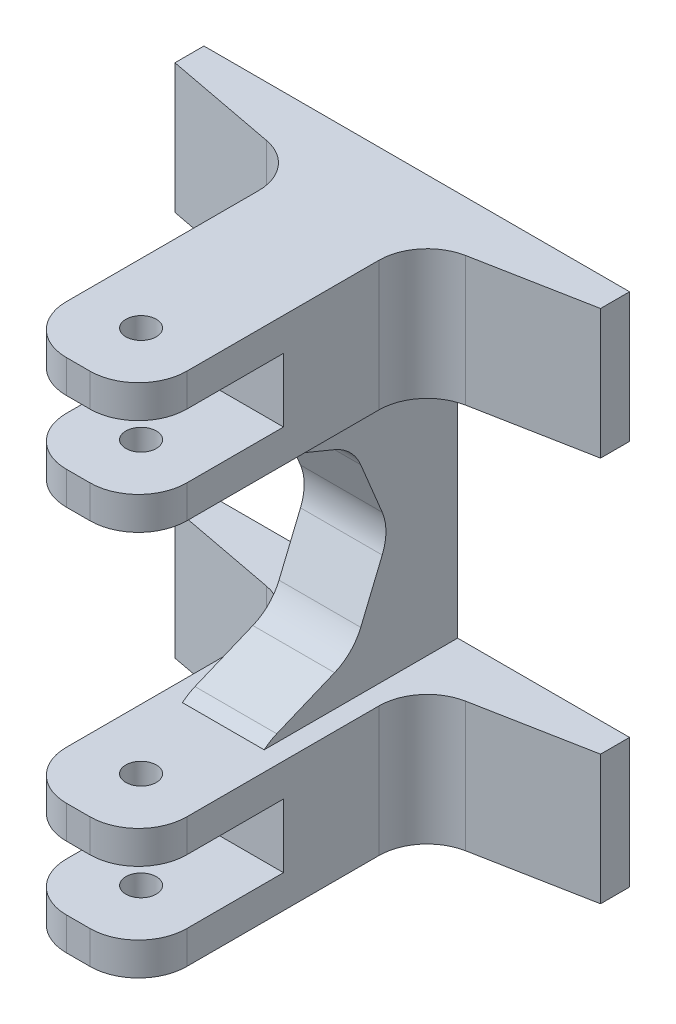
ISO-10303-21;
HEADER;
FILE_DESCRIPTION(('STEP AP214'),'2;1');
FILE_NAME('part.step','',(''),(''),'','','');
FILE_SCHEMA(('AUTOMOTIVE_DESIGN { 1 0 10303 214 1 1 1 1 }'));
ENDSEC;
DATA;
#1=APPLICATION_CONTEXT('core data for automotive mechanical design processes');
#2=APPLICATION_PROTOCOL_DEFINITION('international standard','automotive_design',2000,#1);
#3=PRODUCT_CONTEXT('',#1,'mechanical');
#4=PRODUCT('Part','Part','',(#3));
#5=PRODUCT_RELATED_PRODUCT_CATEGORY('part','',(#4));
#6=PRODUCT_DEFINITION_FORMATION('','',#4);
#7=PRODUCT_DEFINITION_CONTEXT('part definition',#1,'design');
#8=PRODUCT_DEFINITION('design','',#6,#7);
#9=PRODUCT_DEFINITION_SHAPE('','',#8);
#10=(LENGTH_UNIT() NAMED_UNIT(*) SI_UNIT(.MILLI.,.METRE.));
#11=(NAMED_UNIT(*) PLANE_ANGLE_UNIT() SI_UNIT($,.RADIAN.));
#12=(NAMED_UNIT(*) SI_UNIT($,.STERADIAN.) SOLID_ANGLE_UNIT());
#13=UNCERTAINTY_MEASURE_WITH_UNIT(LENGTH_MEASURE(1.E-05),#10,'distance_accuracy_value','');
#14=(GEOMETRIC_REPRESENTATION_CONTEXT(3) GLOBAL_UNCERTAINTY_ASSIGNED_CONTEXT((#13)) GLOBAL_UNIT_ASSIGNED_CONTEXT((#10,
#11,#12)) REPRESENTATION_CONTEXT('',''));
#15=CARTESIAN_POINT('',(0.,0.,0.));
#16=DIRECTION('',(0.,0.,1.));
#17=DIRECTION('',(1.,0.,0.));
#18=AXIS2_PLACEMENT_3D('',#15,#16,#17);
#19=CARTESIAN_POINT('',(6.225,53.3,17.5));
#20=DIRECTION('',(-1.,0.,0.));
#21=DIRECTION('',(0.,0.,1.));
#22=AXIS2_PLACEMENT_3D('',#19,#20,#21);
#23=PLANE('',#22);
#24=DIRECTION('',(0.,0.,-1.));
#25=VECTOR('',#24,1.);
#26=CARTESIAN_POINT('',(6.225,0.,17.5));
#27=LINE('',#26,#25);
#28=CARTESIAN_POINT('',(6.225,0.,12.5));
#29=VERTEX_POINT('',#28);
#30=CARTESIAN_POINT('',(6.225,0.,-7.36125898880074));
#31=VERTEX_POINT('',#30);
#32=EDGE_CURVE('E356',#29,#31,#27,.T.);
#33=ORIENTED_EDGE('',*,*,#32,.T.);
#34=DIRECTION('',(0.,-1.,0.));
#35=VECTOR('',#34,1.);
#36=CARTESIAN_POINT('',(6.225,13.4,-7.36125898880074));
#37=LINE('',#36,#35);
#38=CARTESIAN_POINT('',(6.225,13.4,-7.36125898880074));
#39=VERTEX_POINT('',#38);
#40=EDGE_CURVE('E48',#31,#39,#37,.F.);
#41=ORIENTED_EDGE('',*,*,#40,.T.);
#42=DIRECTION('',(0.,0.,-1.));
#43=VECTOR('',#42,1.);
#44=CARTESIAN_POINT('',(6.225,13.4,0.));
#45=LINE('',#44,#43);
#46=CARTESIAN_POINT('',(6.225,13.4,12.5));
#47=VERTEX_POINT('',#46);
#48=EDGE_CURVE('E501',#47,#39,#45,.T.);
#49=ORIENTED_EDGE('',*,*,#48,.F.);
#50=DIRECTION('',(0.,1.,0.));
#51=VECTOR('',#50,1.);
#52=CARTESIAN_POINT('',(6.225,0.,12.5));
#53=LINE('',#52,#51);
#54=CARTESIAN_POINT('',(6.225,10.,12.5));
#55=VERTEX_POINT('',#54);
#56=EDGE_CURVE('E749',#55,#47,#53,.T.);
#57=ORIENTED_EDGE('',*,*,#56,.F.);
#58=DIRECTION('',(0.,0.,-1.));
#59=VECTOR('',#58,1.);
#60=CARTESIAN_POINT('',(6.225,10.,0.));
#61=LINE('',#60,#59);
#62=CARTESIAN_POINT('',(6.225,10.,2.5));
#63=VERTEX_POINT('',#62);
#64=EDGE_CURVE('E617',#55,#63,#61,.T.);
#65=ORIENTED_EDGE('',*,*,#64,.T.);
#66=DIRECTION('',(0.,1.,0.));
#67=VECTOR('',#66,1.);
#68=CARTESIAN_POINT('',(6.225,0.,2.5));
#69=LINE('',#68,#67);
#70=CARTESIAN_POINT('',(6.225,3.4,2.5));
#71=VERTEX_POINT('',#70);
#72=EDGE_CURVE('E625',#71,#63,#69,.T.);
#73=ORIENTED_EDGE('',*,*,#72,.F.);
#74=DIRECTION('',(0.,0.,-1.));
#75=VECTOR('',#74,1.);
#76=CARTESIAN_POINT('',(6.225,3.4,0.));
#77=LINE('',#76,#75);
#78=CARTESIAN_POINT('',(6.225,3.4,12.5));
#79=VERTEX_POINT('',#78);
#80=EDGE_CURVE('E623',#79,#71,#77,.T.);
#81=ORIENTED_EDGE('',*,*,#80,.F.);
#82=EDGE_CURVE('E753',#29,#79,#53,.T.);
#83=ORIENTED_EDGE('',*,*,#82,.F.);
#84=EDGE_LOOP('',(#33,#41,#49,#57,#65,#73,#81,#83));
#85=FACE_BOUND('',#84,.T.);
#86=ADVANCED_FACE('F33',(#85),#23,.F.);
#87=DIRECTION('',(0.,0.,-1.));
#88=VECTOR('',#87,1.);
#89=CARTESIAN_POINT('',(6.225,39.9,0.));
#90=LINE('',#89,#88);
#91=CARTESIAN_POINT('',(6.225,39.9,12.5));
#92=VERTEX_POINT('',#91);
#93=CARTESIAN_POINT('',(6.225,39.9,-7.36125898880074));
#94=VERTEX_POINT('',#93);
#95=EDGE_CURVE('E492',#92,#94,#90,.T.);
#96=ORIENTED_EDGE('',*,*,#95,.T.);
#97=DIRECTION('',(0.,-1.,0.));
#98=VECTOR('',#97,1.);
#99=CARTESIAN_POINT('',(6.225,53.3,-7.36125898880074));
#100=LINE('',#99,#98);
#101=CARTESIAN_POINT('',(6.225,53.3,-7.36125898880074));
#102=VERTEX_POINT('',#101);
#103=EDGE_CURVE('E449',#94,#102,#100,.F.);
#104=ORIENTED_EDGE('',*,*,#103,.T.);
#105=DIRECTION('',(0.,0.,-1.));
#106=VECTOR('',#105,1.);
#107=CARTESIAN_POINT('',(6.225,53.3,17.5));
#108=LINE('',#107,#106);
#109=CARTESIAN_POINT('',(6.225,53.3,12.5));
#110=VERTEX_POINT('',#109);
#111=EDGE_CURVE('E362',#110,#102,#108,.T.);
#112=ORIENTED_EDGE('',*,*,#111,.F.);
#113=CARTESIAN_POINT('',(6.225,49.9,12.5));
#114=VERTEX_POINT('',#113);
#115=EDGE_CURVE('E348',#114,#110,#53,.T.);
#116=ORIENTED_EDGE('',*,*,#115,.F.);
#117=DIRECTION('',(0.,0.,-1.));
#118=VECTOR('',#117,1.);
#119=CARTESIAN_POINT('',(6.225,49.9,0.));
#120=LINE('',#119,#118);
#121=CARTESIAN_POINT('',(6.225,49.9,2.5));
#122=VERTEX_POINT('',#121);
#123=EDGE_CURVE('E650',#114,#122,#120,.T.);
#124=ORIENTED_EDGE('',*,*,#123,.T.);
#125=DIRECTION('',(0.,-1.,0.));
#126=VECTOR('',#125,1.);
#127=CARTESIAN_POINT('',(6.225,0.,2.5));
#128=LINE('',#127,#126);
#129=CARTESIAN_POINT('',(6.225,43.3,2.5));
#130=VERTEX_POINT('',#129);
#131=EDGE_CURVE('E513',#122,#130,#128,.T.);
#132=ORIENTED_EDGE('',*,*,#131,.T.);
#133=DIRECTION('',(0.,0.,-1.));
#134=VECTOR('',#133,1.);
#135=CARTESIAN_POINT('',(6.225,43.3,0.));
#136=LINE('',#135,#134);
#137=CARTESIAN_POINT('',(6.225,43.3,12.5));
#138=VERTEX_POINT('',#137);
#139=EDGE_CURVE('E643',#138,#130,#136,.T.);
#140=ORIENTED_EDGE('',*,*,#139,.F.);
#141=EDGE_CURVE('E499',#92,#138,#53,.T.);
#142=ORIENTED_EDGE('',*,*,#141,.F.);
#143=EDGE_LOOP('',(#96,#104,#112,#116,#124,#132,#140,#142));
#144=FACE_BOUND('',#143,.T.);
#145=ADVANCED_FACE('F497',(#144),#23,.F.);
#146=CARTESIAN_POINT('',(-6.225,53.3,17.5));
#147=DIRECTION('',(0.,0.,-1.));
#148=DIRECTION('',(-1.,0.,0.));
#149=AXIS2_PLACEMENT_3D('',#146,#147,#148);
#150=PLANE('',#149);
#151=DIRECTION('',(1.,0.,0.));
#152=VECTOR('',#151,1.);
#153=CARTESIAN_POINT('',(-6.225,10.,17.5));
#154=LINE('',#153,#152);
#155=CARTESIAN_POINT('',(-1.22499999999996,10.,17.5));
#156=VERTEX_POINT('',#155);
#157=CARTESIAN_POINT('',(1.22499999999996,10.,17.5));
#158=VERTEX_POINT('',#157);
#159=EDGE_CURVE('E631',#156,#158,#154,.T.);
#160=ORIENTED_EDGE('',*,*,#159,.T.);
#161=DIRECTION('',(0.,1.,0.));
#162=VECTOR('',#161,1.);
#163=CARTESIAN_POINT('',(1.22499999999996,0.,17.5));
#164=LINE('',#163,#162);
#165=CARTESIAN_POINT('',(1.22499999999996,13.4,17.5));
#166=VERTEX_POINT('',#165);
#167=EDGE_CURVE('E349',#158,#166,#164,.T.);
#168=ORIENTED_EDGE('',*,*,#167,.T.);
#169=DIRECTION('',(1.,0.,0.));
#170=VECTOR('',#169,1.);
#171=CARTESIAN_POINT('',(-6.225,13.4,17.5));
#172=LINE('',#171,#170);
#173=CARTESIAN_POINT('',(-1.22499999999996,13.4,17.5));
#174=VERTEX_POINT('',#173);
#175=EDGE_CURVE('E510',#174,#166,#172,.T.);
#176=ORIENTED_EDGE('',*,*,#175,.F.);
#177=DIRECTION('',(0.,1.,0.));
#178=VECTOR('',#177,1.);
#179=CARTESIAN_POINT('',(-1.22499999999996,0.,17.5));
#180=LINE('',#179,#178);
#181=EDGE_CURVE('E1354',#156,#174,#180,.T.);
#182=ORIENTED_EDGE('',*,*,#181,.F.);
#183=EDGE_LOOP('',(#160,#168,#176,#182));
#184=FACE_BOUND('',#183,.T.);
#185=ADVANCED_FACE('F818',(#184),#150,.F.);
#186=DIRECTION('',(1.,0.,0.));
#187=VECTOR('',#186,1.);
#188=CARTESIAN_POINT('',(-6.225,49.9,17.5));
#189=LINE('',#188,#187);
#190=CARTESIAN_POINT('',(-1.22499999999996,49.9,17.5));
#191=VERTEX_POINT('',#190);
#192=CARTESIAN_POINT('',(1.22499999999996,49.9,17.5));
#193=VERTEX_POINT('',#192);
#194=EDGE_CURVE('E658',#191,#193,#189,.T.);
#195=ORIENTED_EDGE('',*,*,#194,.T.);
#196=CARTESIAN_POINT('',(1.22499999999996,53.3,17.5));
#197=VERTEX_POINT('',#196);
#198=EDGE_CURVE('E351',#193,#197,#164,.T.);
#199=ORIENTED_EDGE('',*,*,#198,.T.);
#200=DIRECTION('',(1.,0.,0.));
#201=VECTOR('',#200,1.);
#202=CARTESIAN_POINT('',(-6.225,53.3,17.5));
#203=LINE('',#202,#201);
#204=CARTESIAN_POINT('',(-1.22499999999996,53.3,17.5));
#205=VERTEX_POINT('',#204);
#206=EDGE_CURVE('E376',#205,#197,#203,.T.);
#207=ORIENTED_EDGE('',*,*,#206,.F.);
#208=EDGE_CURVE('E1350',#191,#205,#180,.T.);
#209=ORIENTED_EDGE('',*,*,#208,.F.);
#210=EDGE_LOOP('',(#195,#199,#207,#209));
#211=FACE_BOUND('',#210,.T.);
#212=ADVANCED_FACE('F1229',(#211),#150,.F.);
#213=DIRECTION('',(1.,0.,0.));
#214=VECTOR('',#213,1.);
#215=CARTESIAN_POINT('',(-6.225,39.9,17.5));
#216=LINE('',#215,#214);
#217=CARTESIAN_POINT('',(-1.22499999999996,39.9,17.5));
#218=VERTEX_POINT('',#217);
#219=CARTESIAN_POINT('',(1.22499999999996,39.9,17.5));
#220=VERTEX_POINT('',#219);
#221=EDGE_CURVE('E514',#218,#220,#216,.T.);
#222=ORIENTED_EDGE('',*,*,#221,.T.);
#223=CARTESIAN_POINT('',(1.22499999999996,43.3,17.5));
#224=VERTEX_POINT('',#223);
#225=EDGE_CURVE('E1362',#220,#224,#164,.T.);
#226=ORIENTED_EDGE('',*,*,#225,.T.);
#227=DIRECTION('',(1.,0.,0.));
#228=VECTOR('',#227,1.);
#229=CARTESIAN_POINT('',(-6.225,43.3,17.5));
#230=LINE('',#229,#228);
#231=CARTESIAN_POINT('',(-1.22499999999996,43.3,17.5));
#232=VERTEX_POINT('',#231);
#233=EDGE_CURVE('E655',#232,#224,#230,.T.);
#234=ORIENTED_EDGE('',*,*,#233,.F.);
#235=EDGE_CURVE('E1336',#218,#232,#180,.T.);
#236=ORIENTED_EDGE('',*,*,#235,.F.);
#237=EDGE_LOOP('',(#222,#226,#234,#236));
#238=FACE_BOUND('',#237,.T.);
#239=ADVANCED_FACE('F1220',(#238),#150,.F.);
#240=DIRECTION('',(1.,0.,0.));
#241=VECTOR('',#240,1.);
#242=CARTESIAN_POINT('',(-6.225,0.,17.5));
#243=LINE('',#242,#241);
#244=CARTESIAN_POINT('',(-1.22499999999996,0.,17.5));
#245=VERTEX_POINT('',#244);
#246=CARTESIAN_POINT('',(1.22499999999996,0.,17.5));
#247=VERTEX_POINT('',#246);
#248=EDGE_CURVE('E355',#245,#247,#243,.T.);
#249=ORIENTED_EDGE('',*,*,#248,.T.);
#250=CARTESIAN_POINT('',(1.22499999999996,3.4,17.5));
#251=VERTEX_POINT('',#250);
#252=EDGE_CURVE('E337',#247,#251,#164,.T.);
#253=ORIENTED_EDGE('',*,*,#252,.T.);
#254=DIRECTION('',(1.,0.,0.));
#255=VECTOR('',#254,1.);
#256=CARTESIAN_POINT('',(-6.225,3.4,17.5));
#257=LINE('',#256,#255);
#258=CARTESIAN_POINT('',(-1.22499999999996,3.4,17.5));
#259=VERTEX_POINT('',#258);
#260=EDGE_CURVE('E529',#259,#251,#257,.T.);
#261=ORIENTED_EDGE('',*,*,#260,.F.);
#262=EDGE_CURVE('E361',#245,#259,#180,.T.);
#263=ORIENTED_EDGE('',*,*,#262,.F.);
#264=EDGE_LOOP('',(#249,#253,#261,#263));
#265=FACE_BOUND('',#264,.T.);
#266=ADVANCED_FACE('F360',(#265),#150,.F.);
#267=CARTESIAN_POINT('',(0.,53.3,0.));
#268=DIRECTION('',(0.,-1.,0.));
#269=DIRECTION('',(0.,0.,-1.));
#270=AXIS2_PLACEMENT_3D('',#267,#268,#269);
#271=PLANE('',#270);
#272=CARTESIAN_POINT('',(0.,53.3,10.9997785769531));
#273=DIRECTION('',(0.,1.,0.));
#274=DIRECTION('',(0.,0.,1.));
#275=AXIS2_PLACEMENT_3D('',#272,#273,#274);
#276=CIRCLE('',#275,1.575);
#277=CARTESIAN_POINT('',(0.,53.3,12.5747785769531));
#278=VERTEX_POINT('',#277);
#279=EDGE_CURVE('E782',#278,#278,#276,.T.);
#280=ORIENTED_EDGE('',*,*,#279,.F.);
#281=EDGE_LOOP('',(#280));
#282=FACE_BOUND('',#281,.T.);
#283=CARTESIAN_POINT('',(1.225,53.3,12.5));
#284=DIRECTION('',(0.,1.,0.));
#285=DIRECTION('',(0.,0.,1.));
#286=AXIS2_PLACEMENT_3D('',#283,#284,#285);
#287=CIRCLE('',#286,5.);
#288=EDGE_CURVE('E357',#197,#110,#287,.T.);
#289=ORIENTED_EDGE('',*,*,#288,.T.);
#290=ORIENTED_EDGE('',*,*,#111,.T.);
#291=CARTESIAN_POINT('',(11.225,53.3,-7.36125898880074));
#292=DIRECTION('',(0.,-1.,0.));
#293=DIRECTION('',(0.,0.,-1.));
#294=AXIS2_PLACEMENT_3D('',#291,#292,#293);
#295=CIRCLE('',#294,5.);
#296=CARTESIAN_POINT('',(10.2908703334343,53.3,-12.2732241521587));
#297=VERTEX_POINT('',#296);
#298=EDGE_CURVE('E465',#102,#297,#295,.T.);
#299=ORIENTED_EDGE('',*,*,#298,.T.);
#300=DIRECTION('',(-0.982393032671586,0.,0.186825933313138));
#301=VECTOR('',#300,1.);
#302=CARTESIAN_POINT('',(6.225,53.3,-11.5));
#303=LINE('',#302,#301);
#304=CARTESIAN_POINT('',(22.,53.3,-14.5));
#305=VERTEX_POINT('',#304);
#306=EDGE_CURVE('E472',#305,#297,#303,.T.);
#307=ORIENTED_EDGE('',*,*,#306,.F.);
#308=DIRECTION('',(0.,0.,-1.));
#309=VECTOR('',#308,1.);
#310=CARTESIAN_POINT('',(22.,53.3,-11.5));
#311=LINE('',#310,#309);
#312=CARTESIAN_POINT('',(22.,53.3,-17.5));
#313=VERTEX_POINT('',#312);
#314=EDGE_CURVE('E567',#305,#313,#311,.T.);
#315=ORIENTED_EDGE('',*,*,#314,.T.);
#316=DIRECTION('',(-1.,0.,0.));
#317=VECTOR('',#316,1.);
#318=CARTESIAN_POINT('',(-6.225,53.3,-17.5));
#319=LINE('',#318,#317);
#320=CARTESIAN_POINT('',(-22.,53.3,-17.5));
#321=VERTEX_POINT('',#320);
#322=EDGE_CURVE('E366',#313,#321,#319,.T.);
#323=ORIENTED_EDGE('',*,*,#322,.T.);
#324=DIRECTION('',(0.,0.,-1.));
#325=VECTOR('',#324,1.);
#326=CARTESIAN_POINT('',(-22.,53.3,-11.5));
#327=LINE('',#326,#325);
#328=CARTESIAN_POINT('',(-22.,53.3,-14.5));
#329=VERTEX_POINT('',#328);
#330=EDGE_CURVE('E575',#329,#321,#327,.T.);
#331=ORIENTED_EDGE('',*,*,#330,.F.);
#332=DIRECTION('',(-0.982393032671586,0.,-0.186825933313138));
#333=VECTOR('',#332,1.);
#334=CARTESIAN_POINT('',(-6.225,53.3,-11.5));
#335=LINE('',#334,#333);
#336=CARTESIAN_POINT('',(-10.2908703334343,53.3,-12.2732241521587));
#337=VERTEX_POINT('',#336);
#338=EDGE_CURVE('E679',#337,#329,#335,.T.);
#339=ORIENTED_EDGE('',*,*,#338,.F.);
#340=CARTESIAN_POINT('',(-11.225,53.3,-7.36125898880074));
#341=DIRECTION('',(0.,-1.,0.));
#342=DIRECTION('',(0.,0.,-1.));
#343=AXIS2_PLACEMENT_3D('',#340,#341,#342);
#344=CIRCLE('',#343,5.);
#345=CARTESIAN_POINT('',(-6.225,53.3,-7.36125898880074));
#346=VERTEX_POINT('',#345);
#347=EDGE_CURVE('E455',#337,#346,#344,.T.);
#348=ORIENTED_EDGE('',*,*,#347,.T.);
#349=DIRECTION('',(0.,0.,1.));
#350=VECTOR('',#349,1.);
#351=CARTESIAN_POINT('',(-6.225,53.3,17.5));
#352=LINE('',#351,#350);
#353=CARTESIAN_POINT('',(-6.225,53.3,12.5));
#354=VERTEX_POINT('',#353);
#355=EDGE_CURVE('E525',#346,#354,#352,.T.);
#356=ORIENTED_EDGE('',*,*,#355,.T.);
#357=CARTESIAN_POINT('',(-1.225,53.3,12.5));
#358=DIRECTION('',(0.,1.,0.));
#359=DIRECTION('',(0.,0.,1.));
#360=AXIS2_PLACEMENT_3D('',#357,#358,#359);
#361=CIRCLE('',#360,5.);
#362=EDGE_CURVE('E1366',#354,#205,#361,.T.);
#363=ORIENTED_EDGE('',*,*,#362,.T.);
#364=ORIENTED_EDGE('',*,*,#206,.T.);
#365=EDGE_LOOP('',(#289,#290,#299,#307,#315,#323,#331,#339,#348,#356,#363,#364));
#366=FACE_BOUND('',#365,.T.);
#367=ADVANCED_FACE('F471',(#282,#366),#271,.F.);
#368=CARTESIAN_POINT('',(0.,0.,0.));
#369=DIRECTION('',(0.,-1.,0.));
#370=DIRECTION('',(0.,0.,-1.));
#371=AXIS2_PLACEMENT_3D('',#368,#369,#370);
#372=PLANE('',#371);
#373=CARTESIAN_POINT('',(0.,0.,10.9997785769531));
#374=DIRECTION('',(0.,1.,0.));
#375=DIRECTION('',(0.,0.,1.));
#376=AXIS2_PLACEMENT_3D('',#373,#374,#375);
#377=CIRCLE('',#376,1.575);
#378=CARTESIAN_POINT('',(0.,0.,12.5747785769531));
#379=VERTEX_POINT('',#378);
#380=EDGE_CURVE('E390',#379,#379,#377,.T.);
#381=ORIENTED_EDGE('',*,*,#380,.T.);
#382=EDGE_LOOP('',(#381));
#383=FACE_BOUND('',#382,.T.);
#384=ORIENTED_EDGE('',*,*,#32,.F.);
#385=CARTESIAN_POINT('',(1.225,0.,12.5));
#386=DIRECTION('',(0.,1.,0.));
#387=DIRECTION('',(0.,0.,1.));
#388=AXIS2_PLACEMENT_3D('',#385,#386,#387);
#389=CIRCLE('',#388,5.);
#390=EDGE_CURVE('E340',#247,#29,#389,.T.);
#391=ORIENTED_EDGE('',*,*,#390,.F.);
#392=ORIENTED_EDGE('',*,*,#248,.F.);
#393=CARTESIAN_POINT('',(-1.225,0.,12.5));
#394=DIRECTION('',(0.,1.,0.));
#395=DIRECTION('',(0.,0.,1.));
#396=AXIS2_PLACEMENT_3D('',#393,#394,#395);
#397=CIRCLE('',#396,5.);
#398=CARTESIAN_POINT('',(-6.225,0.,12.5));
#399=VERTEX_POINT('',#398);
#400=EDGE_CURVE('E1365',#399,#245,#397,.T.);
#401=ORIENTED_EDGE('',*,*,#400,.F.);
#402=DIRECTION('',(0.,0.,1.));
#403=VECTOR('',#402,1.);
#404=CARTESIAN_POINT('',(-6.225,0.,17.5));
#405=LINE('',#404,#403);
#406=CARTESIAN_POINT('',(-6.225,0.,-7.36125898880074));
#407=VERTEX_POINT('',#406);
#408=EDGE_CURVE('E363',#407,#399,#405,.T.);
#409=ORIENTED_EDGE('',*,*,#408,.F.);
#410=CARTESIAN_POINT('',(-11.225,0.,-7.36125898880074));
#411=DIRECTION('',(0.,-1.,0.));
#412=DIRECTION('',(0.,0.,-1.));
#413=AXIS2_PLACEMENT_3D('',#410,#411,#412);
#414=CIRCLE('',#413,5.);
#415=CARTESIAN_POINT('',(-10.2908703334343,0.,-12.2732241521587));
#416=VERTEX_POINT('',#415);
#417=EDGE_CURVE('E461',#407,#416,#414,.F.);
#418=ORIENTED_EDGE('',*,*,#417,.T.);
#419=DIRECTION('',(-0.982393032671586,0.,-0.186825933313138));
#420=VECTOR('',#419,1.);
#421=CARTESIAN_POINT('',(-6.225,0.,-11.5));
#422=LINE('',#421,#420);
#423=CARTESIAN_POINT('',(-22.,0.,-14.5));
#424=VERTEX_POINT('',#423);
#425=EDGE_CURVE('E684',#416,#424,#422,.T.);
#426=ORIENTED_EDGE('',*,*,#425,.T.);
#427=DIRECTION('',(0.,0.,-1.));
#428=VECTOR('',#427,1.);
#429=CARTESIAN_POINT('',(-22.,0.,-11.5));
#430=LINE('',#429,#428);
#431=CARTESIAN_POINT('',(-22.,0.,-17.5));
#432=VERTEX_POINT('',#431);
#433=EDGE_CURVE('E548',#424,#432,#430,.T.);
#434=ORIENTED_EDGE('',*,*,#433,.T.);
#435=DIRECTION('',(-1.,0.,0.));
#436=VECTOR('',#435,1.);
#437=CARTESIAN_POINT('',(-6.225,0.,-17.5));
#438=LINE('',#437,#436);
#439=CARTESIAN_POINT('',(22.,0.,-17.5));
#440=VERTEX_POINT('',#439);
#441=EDGE_CURVE('E368',#440,#432,#438,.T.);
#442=ORIENTED_EDGE('',*,*,#441,.F.);
#443=DIRECTION('',(0.,0.,-1.));
#444=VECTOR('',#443,1.);
#445=CARTESIAN_POINT('',(22.,0.,-11.5));
#446=LINE('',#445,#444);
#447=CARTESIAN_POINT('',(22.,0.,-14.5));
#448=VERTEX_POINT('',#447);
#449=EDGE_CURVE('E561',#448,#440,#446,.T.);
#450=ORIENTED_EDGE('',*,*,#449,.F.);
#451=DIRECTION('',(-0.982393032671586,0.,0.186825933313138));
#452=VECTOR('',#451,1.);
#453=CARTESIAN_POINT('',(6.225,0.,-11.5));
#454=LINE('',#453,#452);
#455=CARTESIAN_POINT('',(10.2908703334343,0.,-12.2732241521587));
#456=VERTEX_POINT('',#455);
#457=EDGE_CURVE('E483',#448,#456,#454,.T.);
#458=ORIENTED_EDGE('',*,*,#457,.T.);
#459=CARTESIAN_POINT('',(11.225,0.,-7.36125898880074));
#460=DIRECTION('',(0.,-1.,0.));
#461=DIRECTION('',(0.,0.,-1.));
#462=AXIS2_PLACEMENT_3D('',#459,#460,#461);
#463=CIRCLE('',#462,5.);
#464=EDGE_CURVE('E41',#456,#31,#463,.F.);
#465=ORIENTED_EDGE('',*,*,#464,.T.);
#466=EDGE_LOOP('',(#384,#391,#392,#401,#409,#418,#426,#434,#442,#450,#458,#465));
#467=FACE_BOUND('',#466,.T.);
#468=ADVANCED_FACE('F353',(#383,#467),#372,.T.);
#469=CARTESIAN_POINT('',(-6.225,13.4,0.));
#470=DIRECTION('',(0.,-1.,0.));
#471=DIRECTION('',(0.,0.,-1.));
#472=AXIS2_PLACEMENT_3D('',#469,#470,#471);
#473=PLANE('',#472);
#474=CARTESIAN_POINT('',(0.,13.4,10.9997785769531));
#475=DIRECTION('',(0.,-1.,0.));
#476=DIRECTION('',(0.,0.,-1.));
#477=AXIS2_PLACEMENT_3D('',#474,#475,#476);
#478=CIRCLE('',#477,1.575);
#479=CARTESIAN_POINT('',(0.,13.4,9.42477857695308));
#480=VERTEX_POINT('',#479);
#481=EDGE_CURVE('E685',#480,#480,#478,.T.);
#482=ORIENTED_EDGE('',*,*,#481,.T.);
#483=EDGE_LOOP('',(#482));
#484=FACE_BOUND('',#483,.T.);
#485=CARTESIAN_POINT('',(1.225,13.4,12.5));
#486=DIRECTION('',(0.,-1.,0.));
#487=DIRECTION('',(0.,0.,-1.));
#488=AXIS2_PLACEMENT_3D('',#485,#486,#487);
#489=CIRCLE('',#488,5.);
#490=EDGE_CURVE('E747',#47,#166,#489,.T.);
#491=ORIENTED_EDGE('',*,*,#490,.F.);
#492=ORIENTED_EDGE('',*,*,#48,.T.);
#493=CARTESIAN_POINT('',(11.225,13.4,-7.36125898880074));
#494=DIRECTION('',(0.,-1.,0.));
#495=DIRECTION('',(0.,0.,-1.));
#496=AXIS2_PLACEMENT_3D('',#493,#494,#495);
#497=CIRCLE('',#496,5.);
#498=CARTESIAN_POINT('',(10.2908703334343,13.4,-12.2732241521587));
#499=VERTEX_POINT('',#498);
#500=EDGE_CURVE('E11',#39,#499,#497,.T.);
#501=ORIENTED_EDGE('',*,*,#500,.T.);
#502=DIRECTION('',(0.982393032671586,0.,-0.186825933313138));
#503=VECTOR('',#502,1.);
#504=CARTESIAN_POINT('',(-7.90111577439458,13.4,-8.81357544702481));
#505=LINE('',#504,#503);
#506=CARTESIAN_POINT('',(22.,13.4,-14.5));
#507=VERTEX_POINT('',#506);
#508=EDGE_CURVE('E552',#499,#507,#505,.T.);
#509=ORIENTED_EDGE('',*,*,#508,.T.);
#510=DIRECTION('',(0.,0.,-1.));
#511=VECTOR('',#510,1.);
#512=CARTESIAN_POINT('',(22.,13.4,-11.5));
#513=LINE('',#512,#511);
#514=CARTESIAN_POINT('',(22.,13.4,-17.5));
#515=VERTEX_POINT('',#514);
#516=EDGE_CURVE('E560',#507,#515,#513,.T.);
#517=ORIENTED_EDGE('',*,*,#516,.T.);
#518=DIRECTION('',(1.,0.,0.));
#519=VECTOR('',#518,1.);
#520=CARTESIAN_POINT('',(4.225,13.4,-17.5));
#521=LINE('',#520,#519);
#522=CARTESIAN_POINT('',(4.225,13.4,-17.5));
#523=VERTEX_POINT('',#522);
#524=EDGE_CURVE('E598',#523,#515,#521,.T.);
#525=ORIENTED_EDGE('',*,*,#524,.F.);
#526=DIRECTION('',(0.,0.,-1.));
#527=VECTOR('',#526,1.);
#528=CARTESIAN_POINT('',(4.225,13.4,0.));
#529=LINE('',#528,#527);
#530=CARTESIAN_POINT('',(4.225,13.4,2.5));
#531=VERTEX_POINT('',#530);
#532=EDGE_CURVE('E584',#531,#523,#529,.T.);
#533=ORIENTED_EDGE('',*,*,#532,.F.);
#534=DIRECTION('',(1.,0.,0.));
#535=VECTOR('',#534,1.);
#536=CARTESIAN_POINT('',(-6.225,13.4,2.5));
#537=LINE('',#536,#535);
#538=CARTESIAN_POINT('',(-4.225,13.4,2.5));
#539=VERTEX_POINT('',#538);
#540=EDGE_CURVE('E520',#539,#531,#537,.T.);
#541=ORIENTED_EDGE('',*,*,#540,.F.);
#542=DIRECTION('',(0.,0.,1.));
#543=VECTOR('',#542,1.);
#544=CARTESIAN_POINT('',(-4.225,13.4,2.5));
#545=LINE('',#544,#543);
#546=CARTESIAN_POINT('',(-4.225,13.4,-17.5));
#547=VERTEX_POINT('',#546);
#548=EDGE_CURVE('E608',#547,#539,#545,.T.);
#549=ORIENTED_EDGE('',*,*,#548,.F.);
#550=DIRECTION('',(-1.,0.,0.));
#551=VECTOR('',#550,1.);
#552=CARTESIAN_POINT('',(-4.225,13.4,-17.5));
#553=LINE('',#552,#551);
#554=CARTESIAN_POINT('',(-22.,13.4,-17.5));
#555=VERTEX_POINT('',#554);
#556=EDGE_CURVE('E506',#547,#555,#553,.T.);
#557=ORIENTED_EDGE('',*,*,#556,.T.);
#558=DIRECTION('',(0.,0.,-1.));
#559=VECTOR('',#558,1.);
#560=CARTESIAN_POINT('',(-22.,13.4,-11.5));
#561=LINE('',#560,#559);
#562=CARTESIAN_POINT('',(-22.,13.4,-14.5));
#563=VERTEX_POINT('',#562);
#564=EDGE_CURVE('E550',#563,#555,#561,.T.);
#565=ORIENTED_EDGE('',*,*,#564,.F.);
#566=DIRECTION('',(0.982393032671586,0.,0.186825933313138));
#567=VECTOR('',#566,1.);
#568=CARTESIAN_POINT('',(-4.11433030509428,13.4,-11.0986048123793));
#569=LINE('',#568,#567);
#570=CARTESIAN_POINT('',(-10.2908703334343,13.4,-12.2732241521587));
#571=VERTEX_POINT('',#570);
#572=EDGE_CURVE('E696',#563,#571,#569,.T.);
#573=ORIENTED_EDGE('',*,*,#572,.T.);
#574=CARTESIAN_POINT('',(-11.225,13.4,-7.36125898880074));
#575=DIRECTION('',(0.,-1.,0.));
#576=DIRECTION('',(0.,0.,-1.));
#577=AXIS2_PLACEMENT_3D('',#574,#575,#576);
#578=CIRCLE('',#577,5.);
#579=CARTESIAN_POINT('',(-6.225,13.4,-7.36125898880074));
#580=VERTEX_POINT('',#579);
#581=EDGE_CURVE('E459',#571,#580,#578,.T.);
#582=ORIENTED_EDGE('',*,*,#581,.T.);
#583=DIRECTION('',(0.,0.,-1.));
#584=VECTOR('',#583,1.);
#585=CARTESIAN_POINT('',(-6.225,13.4,0.));
#586=LINE('',#585,#584);
#587=CARTESIAN_POINT('',(-6.225,13.4,12.5));
#588=VERTEX_POINT('',#587);
#589=EDGE_CURVE('E500',#588,#580,#586,.T.);
#590=ORIENTED_EDGE('',*,*,#589,.F.);
#591=CARTESIAN_POINT('',(-1.225,13.4,12.5));
#592=DIRECTION('',(0.,-1.,0.));
#593=DIRECTION('',(0.,0.,-1.));
#594=AXIS2_PLACEMENT_3D('',#591,#592,#593);
#595=CIRCLE('',#594,5.);
#596=EDGE_CURVE('E770',#174,#588,#595,.T.);
#597=ORIENTED_EDGE('',*,*,#596,.F.);
#598=ORIENTED_EDGE('',*,*,#175,.T.);
#599=EDGE_LOOP('',(#491,#492,#501,#509,#517,#525,#533,#541,#549,#557,#565,#573,#582,#590,#597,#598));
#600=FACE_BOUND('',#599,.T.);
#601=ADVANCED_FACE('F719',(#484,#600),#473,.F.);
#602=CARTESIAN_POINT('',(-6.225,39.9,0.));
#603=DIRECTION('',(0.,-1.,0.));
#604=DIRECTION('',(0.,0.,-1.));
#605=AXIS2_PLACEMENT_3D('',#602,#603,#604);
#606=PLANE('',#605);
#607=CARTESIAN_POINT('',(0.,39.9,10.9997785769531));
#608=DIRECTION('',(0.,-1.,0.));
#609=DIRECTION('',(0.,0.,-1.));
#610=AXIS2_PLACEMENT_3D('',#607,#608,#609);
#611=CIRCLE('',#610,1.575);
#612=CARTESIAN_POINT('',(0.,39.9,9.42477857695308));
#613=VERTEX_POINT('',#612);
#614=EDGE_CURVE('E690',#613,#613,#611,.T.);
#615=ORIENTED_EDGE('',*,*,#614,.F.);
#616=EDGE_LOOP('',(#615));
#617=FACE_BOUND('',#616,.T.);
#618=ORIENTED_EDGE('',*,*,#95,.F.);
#619=CARTESIAN_POINT('',(1.225,39.9,12.5));
#620=DIRECTION('',(0.,-1.,0.));
#621=DIRECTION('',(0.,0.,-1.));
#622=AXIS2_PLACEMENT_3D('',#619,#620,#621);
#623=CIRCLE('',#622,5.);
#624=EDGE_CURVE('E779',#92,#220,#623,.T.);
#625=ORIENTED_EDGE('',*,*,#624,.T.);
#626=ORIENTED_EDGE('',*,*,#221,.F.);
#627=CARTESIAN_POINT('',(-1.225,39.9,12.5));
#628=DIRECTION('',(0.,-1.,0.));
#629=DIRECTION('',(0.,0.,-1.));
#630=AXIS2_PLACEMENT_3D('',#627,#628,#629);
#631=CIRCLE('',#630,5.);
#632=CARTESIAN_POINT('',(-6.225,39.9,12.5));
#633=VERTEX_POINT('',#632);
#634=EDGE_CURVE('E669',#218,#633,#631,.T.);
#635=ORIENTED_EDGE('',*,*,#634,.T.);
#636=DIRECTION('',(0.,0.,-1.));
#637=VECTOR('',#636,1.);
#638=CARTESIAN_POINT('',(-6.225,39.9,0.));
#639=LINE('',#638,#637);
#640=CARTESIAN_POINT('',(-6.225,39.9,-7.36125898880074));
#641=VERTEX_POINT('',#640);
#642=EDGE_CURVE('E504',#633,#641,#639,.T.);
#643=ORIENTED_EDGE('',*,*,#642,.T.);
#644=CARTESIAN_POINT('',(-11.225,39.9,-7.36125898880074));
#645=DIRECTION('',(0.,-1.,0.));
#646=DIRECTION('',(0.,0.,-1.));
#647=AXIS2_PLACEMENT_3D('',#644,#645,#646);
#648=CIRCLE('',#647,5.);
#649=CARTESIAN_POINT('',(-10.2908703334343,39.9,-12.2732241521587));
#650=VERTEX_POINT('',#649);
#651=EDGE_CURVE('E457',#641,#650,#648,.F.);
#652=ORIENTED_EDGE('',*,*,#651,.T.);
#653=DIRECTION('',(0.982393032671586,0.,0.186825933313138));
#654=VECTOR('',#653,1.);
#655=CARTESIAN_POINT('',(-4.11433030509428,39.9,-11.0986048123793));
#656=LINE('',#655,#654);
#657=CARTESIAN_POINT('',(-22.,39.9,-14.5));
#658=VERTEX_POINT('',#657);
#659=EDGE_CURVE('E681',#658,#650,#656,.T.);
#660=ORIENTED_EDGE('',*,*,#659,.F.);
#661=DIRECTION('',(0.,0.,-1.));
#662=VECTOR('',#661,1.);
#663=CARTESIAN_POINT('',(-22.,39.9,-11.5));
#664=LINE('',#663,#662);
#665=CARTESIAN_POINT('',(-22.,39.9,-17.5));
#666=VERTEX_POINT('',#665);
#667=EDGE_CURVE('E574',#658,#666,#664,.T.);
#668=ORIENTED_EDGE('',*,*,#667,.T.);
#669=DIRECTION('',(-1.,0.,0.));
#670=VECTOR('',#669,1.);
#671=CARTESIAN_POINT('',(-4.225,39.9,-17.5));
#672=LINE('',#671,#670);
#673=CARTESIAN_POINT('',(-4.225,39.9,-17.5));
#674=VERTEX_POINT('',#673);
#675=EDGE_CURVE('E610',#674,#666,#672,.T.);
#676=ORIENTED_EDGE('',*,*,#675,.F.);
#677=DIRECTION('',(0.,0.,-1.));
#678=VECTOR('',#677,1.);
#679=CARTESIAN_POINT('',(-4.225,39.9,2.5));
#680=LINE('',#679,#678);
#681=CARTESIAN_POINT('',(-4.225,39.9,2.5));
#682=VERTEX_POINT('',#681);
#683=EDGE_CURVE('E602',#682,#674,#680,.T.);
#684=ORIENTED_EDGE('',*,*,#683,.F.);
#685=DIRECTION('',(1.,0.,0.));
#686=VECTOR('',#685,1.);
#687=CARTESIAN_POINT('',(-6.225,39.9,2.5));
#688=LINE('',#687,#686);
#689=CARTESIAN_POINT('',(4.225,39.9,2.5));
#690=VERTEX_POINT('',#689);
#691=EDGE_CURVE('E517',#682,#690,#688,.T.);
#692=ORIENTED_EDGE('',*,*,#691,.T.);
#693=DIRECTION('',(0.,0.,-1.));
#694=VECTOR('',#693,1.);
#695=CARTESIAN_POINT('',(4.225,39.9,0.));
#696=LINE('',#695,#694);
#697=CARTESIAN_POINT('',(4.225,39.9,-17.5));
#698=VERTEX_POINT('',#697);
#699=EDGE_CURVE('E590',#690,#698,#696,.T.);
#700=ORIENTED_EDGE('',*,*,#699,.T.);
#701=DIRECTION('',(1.,0.,0.));
#702=VECTOR('',#701,1.);
#703=CARTESIAN_POINT('',(4.225,39.9,-17.5));
#704=LINE('',#703,#702);
#705=CARTESIAN_POINT('',(22.,39.9,-17.5));
#706=VERTEX_POINT('',#705);
#707=EDGE_CURVE('E599',#698,#706,#704,.T.);
#708=ORIENTED_EDGE('',*,*,#707,.T.);
#709=DIRECTION('',(0.,0.,-1.));
#710=VECTOR('',#709,1.);
#711=CARTESIAN_POINT('',(22.,39.9,-11.5));
#712=LINE('',#711,#710);
#713=CARTESIAN_POINT('',(22.,39.9,-14.5));
#714=VERTEX_POINT('',#713);
#715=EDGE_CURVE('E568',#714,#706,#712,.T.);
#716=ORIENTED_EDGE('',*,*,#715,.F.);
#717=DIRECTION('',(0.982393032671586,0.,-0.186825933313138));
#718=VECTOR('',#717,1.);
#719=CARTESIAN_POINT('',(-7.90111577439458,39.9,-8.81357544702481));
#720=LINE('',#719,#718);
#721=CARTESIAN_POINT('',(10.2908703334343,39.9,-12.2732241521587));
#722=VERTEX_POINT('',#721);
#723=EDGE_CURVE('E494',#722,#714,#720,.T.);
#724=ORIENTED_EDGE('',*,*,#723,.F.);
#725=CARTESIAN_POINT('',(11.225,39.9,-7.36125898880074));
#726=DIRECTION('',(0.,-1.,0.));
#727=DIRECTION('',(0.,0.,-1.));
#728=AXIS2_PLACEMENT_3D('',#725,#726,#727);
#729=CIRCLE('',#728,5.);
#730=EDGE_CURVE('E463',#722,#94,#729,.F.);
#731=ORIENTED_EDGE('',*,*,#730,.T.);
#732=EDGE_LOOP('',(#618,#625,#626,#635,#643,#652,#660,#668,#676,#684,#692,#700,#708,#716,#724,#731));
#733=FACE_BOUND('',#732,.T.);
#734=ADVANCED_FACE('F490',(#617,#733),#606,.T.);
#735=CARTESIAN_POINT('',(-6.225,43.3,0.));
#736=DIRECTION('',(0.,-1.,0.));
#737=DIRECTION('',(0.,0.,-1.));
#738=AXIS2_PLACEMENT_3D('',#735,#736,#737);
#739=PLANE('',#738);
#740=CARTESIAN_POINT('',(0.,43.3,10.9997785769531));
#741=DIRECTION('',(0.,-1.,0.));
#742=DIRECTION('',(0.,0.,-1.));
#743=AXIS2_PLACEMENT_3D('',#740,#741,#742);
#744=CIRCLE('',#743,1.575);
#745=CARTESIAN_POINT('',(0.,43.3,9.42477857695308));
#746=VERTEX_POINT('',#745);
#747=EDGE_CURVE('E792',#746,#746,#744,.T.);
#748=ORIENTED_EDGE('',*,*,#747,.T.);
#749=EDGE_LOOP('',(#748));
#750=FACE_BOUND('',#749,.T.);
#751=CARTESIAN_POINT('',(1.225,43.3,12.5));
#752=DIRECTION('',(0.,-1.,0.));
#753=DIRECTION('',(0.,0.,-1.));
#754=AXIS2_PLACEMENT_3D('',#751,#752,#753);
#755=CIRCLE('',#754,5.);
#756=EDGE_CURVE('E773',#138,#224,#755,.T.);
#757=ORIENTED_EDGE('',*,*,#756,.F.);
#758=ORIENTED_EDGE('',*,*,#139,.T.);
#759=DIRECTION('',(1.,0.,0.));
#760=VECTOR('',#759,1.);
#761=CARTESIAN_POINT('',(-6.225,43.3,2.5));
#762=LINE('',#761,#760);
#763=CARTESIAN_POINT('',(-6.225,43.3,2.5));
#764=VERTEX_POINT('',#763);
#765=EDGE_CURVE('E626',#764,#130,#762,.T.);
#766=ORIENTED_EDGE('',*,*,#765,.F.);
#767=DIRECTION('',(0.,0.,-1.));
#768=VECTOR('',#767,1.);
#769=CARTESIAN_POINT('',(-6.225,43.3,0.));
#770=LINE('',#769,#768);
#771=CARTESIAN_POINT('',(-6.225,43.3,12.5));
#772=VERTEX_POINT('',#771);
#773=EDGE_CURVE('E645',#772,#764,#770,.T.);
#774=ORIENTED_EDGE('',*,*,#773,.F.);
#775=CARTESIAN_POINT('',(-1.225,43.3,12.5));
#776=DIRECTION('',(0.,-1.,0.));
#777=DIRECTION('',(0.,0.,-1.));
#778=AXIS2_PLACEMENT_3D('',#775,#776,#777);
#779=CIRCLE('',#778,5.);
#780=EDGE_CURVE('E1327',#232,#772,#779,.T.);
#781=ORIENTED_EDGE('',*,*,#780,.F.);
#782=ORIENTED_EDGE('',*,*,#233,.T.);
#783=EDGE_LOOP('',(#757,#758,#766,#774,#781,#782));
#784=FACE_BOUND('',#783,.T.);
#785=ADVANCED_FACE('F801',(#750,#784),#739,.F.);
#786=CARTESIAN_POINT('',(-6.225,49.9,0.));
#787=DIRECTION('',(0.,-1.,0.));
#788=DIRECTION('',(0.,0.,-1.));
#789=AXIS2_PLACEMENT_3D('',#786,#787,#788);
#790=PLANE('',#789);
#791=CARTESIAN_POINT('',(0.,49.9,10.9997785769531));
#792=DIRECTION('',(0.,-1.,0.));
#793=DIRECTION('',(0.,0.,-1.));
#794=AXIS2_PLACEMENT_3D('',#791,#792,#793);
#795=CIRCLE('',#794,1.575);
#796=CARTESIAN_POINT('',(0.,49.9,9.42477857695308));
#797=VERTEX_POINT('',#796);
#798=EDGE_CURVE('E789',#797,#797,#795,.T.);
#799=ORIENTED_EDGE('',*,*,#798,.F.);
#800=EDGE_LOOP('',(#799));
#801=FACE_BOUND('',#800,.T.);
#802=ORIENTED_EDGE('',*,*,#123,.F.);
#803=CARTESIAN_POINT('',(1.225,49.9,12.5));
#804=DIRECTION('',(0.,-1.,0.));
#805=DIRECTION('',(0.,0.,-1.));
#806=AXIS2_PLACEMENT_3D('',#803,#804,#805);
#807=CIRCLE('',#806,5.);
#808=EDGE_CURVE('E769',#114,#193,#807,.T.);
#809=ORIENTED_EDGE('',*,*,#808,.T.);
#810=ORIENTED_EDGE('',*,*,#194,.F.);
#811=CARTESIAN_POINT('',(-1.225,49.9,12.5));
#812=DIRECTION('',(0.,-1.,0.));
#813=DIRECTION('',(0.,0.,-1.));
#814=AXIS2_PLACEMENT_3D('',#811,#812,#813);
#815=CIRCLE('',#814,5.);
#816=CARTESIAN_POINT('',(-6.225,49.9,12.5));
#817=VERTEX_POINT('',#816);
#818=EDGE_CURVE('E1322',#191,#817,#815,.T.);
#819=ORIENTED_EDGE('',*,*,#818,.T.);
#820=DIRECTION('',(0.,0.,-1.));
#821=VECTOR('',#820,1.);
#822=CARTESIAN_POINT('',(-6.225,49.9,0.));
#823=LINE('',#822,#821);
#824=CARTESIAN_POINT('',(-6.225,49.9,2.5));
#825=VERTEX_POINT('',#824);
#826=EDGE_CURVE('E642',#817,#825,#823,.T.);
#827=ORIENTED_EDGE('',*,*,#826,.T.);
#828=DIRECTION('',(1.,0.,0.));
#829=VECTOR('',#828,1.);
#830=CARTESIAN_POINT('',(-6.225,49.9,2.5));
#831=LINE('',#830,#829);
#832=EDGE_CURVE('E647',#825,#122,#831,.T.);
#833=ORIENTED_EDGE('',*,*,#832,.T.);
#834=EDGE_LOOP('',(#802,#809,#810,#819,#827,#833));
#835=FACE_BOUND('',#834,.T.);
#836=ADVANCED_FACE('F807',(#801,#835),#790,.T.);
#837=CARTESIAN_POINT('',(-6.225,3.4,0.));
#838=DIRECTION('',(0.,-1.,0.));
#839=DIRECTION('',(0.,0.,-1.));
#840=AXIS2_PLACEMENT_3D('',#837,#838,#839);
#841=PLANE('',#840);
#842=CARTESIAN_POINT('',(0.,3.4,10.9997785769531));
#843=DIRECTION('',(0.,-1.,0.));
#844=DIRECTION('',(0.,0.,-1.));
#845=AXIS2_PLACEMENT_3D('',#842,#843,#844);
#846=CIRCLE('',#845,1.575);
#847=CARTESIAN_POINT('',(0.,3.4,9.42477857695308));
#848=VERTEX_POINT('',#847);
#849=EDGE_CURVE('E389',#848,#848,#846,.T.);
#850=ORIENTED_EDGE('',*,*,#849,.T.);
#851=EDGE_LOOP('',(#850));
#852=FACE_BOUND('',#851,.T.);
#853=CARTESIAN_POINT('',(1.225,3.4,12.5));
#854=DIRECTION('',(0.,-1.,0.));
#855=DIRECTION('',(0.,0.,-1.));
#856=AXIS2_PLACEMENT_3D('',#853,#854,#855);
#857=CIRCLE('',#856,5.);
#858=EDGE_CURVE('E343',#79,#251,#857,.T.);
#859=ORIENTED_EDGE('',*,*,#858,.F.);
#860=ORIENTED_EDGE('',*,*,#80,.T.);
#861=DIRECTION('',(1.,0.,0.));
#862=VECTOR('',#861,1.);
#863=CARTESIAN_POINT('',(-6.225,3.4,2.5));
#864=LINE('',#863,#862);
#865=CARTESIAN_POINT('',(-6.225,3.4,2.5));
#866=VERTEX_POINT('',#865);
#867=EDGE_CURVE('E622',#866,#71,#864,.T.);
#868=ORIENTED_EDGE('',*,*,#867,.F.);
#869=DIRECTION('',(0.,0.,-1.));
#870=VECTOR('',#869,1.);
#871=CARTESIAN_POINT('',(-6.225,3.4,0.));
#872=LINE('',#871,#870);
#873=CARTESIAN_POINT('',(-6.225,3.4,12.5));
#874=VERTEX_POINT('',#873);
#875=EDGE_CURVE('E614',#874,#866,#872,.T.);
#876=ORIENTED_EDGE('',*,*,#875,.F.);
#877=CARTESIAN_POINT('',(-1.225,3.4,12.5));
#878=DIRECTION('',(0.,-1.,0.));
#879=DIRECTION('',(0.,0.,-1.));
#880=AXIS2_PLACEMENT_3D('',#877,#878,#879);
#881=CIRCLE('',#880,5.);
#882=EDGE_CURVE('E1321',#259,#874,#881,.T.);
#883=ORIENTED_EDGE('',*,*,#882,.F.);
#884=ORIENTED_EDGE('',*,*,#260,.T.);
#885=EDGE_LOOP('',(#859,#860,#868,#876,#883,#884));
#886=FACE_BOUND('',#885,.T.);
#887=ADVANCED_FACE('F766',(#852,#886),#841,.F.);
#888=CARTESIAN_POINT('',(-6.225,10.,0.));
#889=DIRECTION('',(0.,-1.,0.));
#890=DIRECTION('',(0.,0.,-1.));
#891=AXIS2_PLACEMENT_3D('',#888,#889,#890);
#892=PLANE('',#891);
#893=CARTESIAN_POINT('',(0.,10.,10.9997785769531));
#894=DIRECTION('',(0.,-1.,0.));
#895=DIRECTION('',(0.,0.,-1.));
#896=AXIS2_PLACEMENT_3D('',#893,#894,#895);
#897=CIRCLE('',#896,1.575);
#898=CARTESIAN_POINT('',(0.,10.,9.42477857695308));
#899=VERTEX_POINT('',#898);
#900=EDGE_CURVE('E386',#899,#899,#897,.T.);
#901=ORIENTED_EDGE('',*,*,#900,.F.);
#902=EDGE_LOOP('',(#901));
#903=FACE_BOUND('',#902,.T.);
#904=ORIENTED_EDGE('',*,*,#64,.F.);
#905=CARTESIAN_POINT('',(1.225,10.,12.5));
#906=DIRECTION('',(0.,-1.,0.));
#907=DIRECTION('',(0.,0.,-1.));
#908=AXIS2_PLACEMENT_3D('',#905,#906,#907);
#909=CIRCLE('',#908,5.);
#910=EDGE_CURVE('E393',#55,#158,#909,.T.);
#911=ORIENTED_EDGE('',*,*,#910,.T.);
#912=ORIENTED_EDGE('',*,*,#159,.F.);
#913=CARTESIAN_POINT('',(-1.225,10.,12.5));
#914=DIRECTION('',(0.,-1.,0.));
#915=DIRECTION('',(0.,0.,-1.));
#916=AXIS2_PLACEMENT_3D('',#913,#914,#915);
#917=CIRCLE('',#916,5.);
#918=CARTESIAN_POINT('',(-6.225,10.,12.5));
#919=VERTEX_POINT('',#918);
#920=EDGE_CURVE('E385',#156,#919,#917,.T.);
#921=ORIENTED_EDGE('',*,*,#920,.T.);
#922=DIRECTION('',(0.,0.,-1.));
#923=VECTOR('',#922,1.);
#924=CARTESIAN_POINT('',(-6.225,10.,0.));
#925=LINE('',#924,#923);
#926=CARTESIAN_POINT('',(-6.225,10.,2.5));
#927=VERTEX_POINT('',#926);
#928=EDGE_CURVE('E620',#919,#927,#925,.T.);
#929=ORIENTED_EDGE('',*,*,#928,.T.);
#930=DIRECTION('',(1.,0.,0.));
#931=VECTOR('',#930,1.);
#932=CARTESIAN_POINT('',(-6.225,10.,2.5));
#933=LINE('',#932,#931);
#934=EDGE_CURVE('E634',#927,#63,#933,.T.);
#935=ORIENTED_EDGE('',*,*,#934,.T.);
#936=EDGE_LOOP('',(#904,#911,#912,#921,#929,#935));
#937=FACE_BOUND('',#936,.T.);
#938=ADVANCED_FACE('F756',(#903,#937),#892,.T.);
#939=CARTESIAN_POINT('',(-6.225,53.3,17.5));
#940=DIRECTION('',(1.,0.,0.));
#941=DIRECTION('',(0.,0.,-1.));
#942=AXIS2_PLACEMENT_3D('',#939,#940,#941);
#943=PLANE('',#942);
#944=ORIENTED_EDGE('',*,*,#589,.T.);
#945=DIRECTION('',(0.,1.,0.));
#946=VECTOR('',#945,1.);
#947=CARTESIAN_POINT('',(-6.225,0.,-7.36125898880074));
#948=LINE('',#947,#946);
#949=EDGE_CURVE('E444',#580,#407,#948,.F.);
#950=ORIENTED_EDGE('',*,*,#949,.T.);
#951=ORIENTED_EDGE('',*,*,#408,.T.);
#952=DIRECTION('',(0.,1.,0.));
#953=VECTOR('',#952,1.);
#954=CARTESIAN_POINT('',(-6.225,0.,12.5));
#955=LINE('',#954,#953);
#956=EDGE_CURVE('E1330',#399,#874,#955,.T.);
#957=ORIENTED_EDGE('',*,*,#956,.T.);
#958=ORIENTED_EDGE('',*,*,#875,.T.);
#959=DIRECTION('',(0.,1.,0.));
#960=VECTOR('',#959,1.);
#961=CARTESIAN_POINT('',(-6.225,0.,2.5));
#962=LINE('',#961,#960);
#963=EDGE_CURVE('E616',#866,#927,#962,.T.);
#964=ORIENTED_EDGE('',*,*,#963,.T.);
#965=ORIENTED_EDGE('',*,*,#928,.F.);
#966=EDGE_CURVE('E1341',#919,#588,#955,.T.);
#967=ORIENTED_EDGE('',*,*,#966,.T.);
#968=EDGE_LOOP('',(#944,#950,#951,#957,#958,#964,#965,#967));
#969=FACE_BOUND('',#968,.T.);
#970=ADVANCED_FACE('F916',(#969),#943,.F.);
#971=ORIENTED_EDGE('',*,*,#355,.F.);
#972=DIRECTION('',(0.,1.,0.));
#973=VECTOR('',#972,1.);
#974=CARTESIAN_POINT('',(-6.225,39.9,-7.36125898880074));
#975=LINE('',#974,#973);
#976=EDGE_CURVE('E439',#346,#641,#975,.F.);
#977=ORIENTED_EDGE('',*,*,#976,.T.);
#978=ORIENTED_EDGE('',*,*,#642,.F.);
#979=EDGE_CURVE('E1334',#633,#772,#955,.T.);
#980=ORIENTED_EDGE('',*,*,#979,.T.);
#981=ORIENTED_EDGE('',*,*,#773,.T.);
#982=DIRECTION('',(0.,-1.,0.));
#983=VECTOR('',#982,1.);
#984=CARTESIAN_POINT('',(-6.225,0.,2.5));
#985=LINE('',#984,#983);
#986=EDGE_CURVE('E639',#825,#764,#985,.T.);
#987=ORIENTED_EDGE('',*,*,#986,.F.);
#988=ORIENTED_EDGE('',*,*,#826,.F.);
#989=EDGE_CURVE('E1342',#817,#354,#955,.T.);
#990=ORIENTED_EDGE('',*,*,#989,.T.);
#991=EDGE_LOOP('',(#971,#977,#978,#980,#981,#987,#988,#990));
#992=FACE_BOUND('',#991,.T.);
#993=ADVANCED_FACE('F911',(#992),#943,.F.);
#994=CARTESIAN_POINT('',(-6.225,53.3,-17.5));
#995=DIRECTION('',(0.,0.,1.));
#996=DIRECTION('',(1.,0.,0.));
#997=AXIS2_PLACEMENT_3D('',#994,#995,#996);
#998=PLANE('',#997);
#999=CARTESIAN_POINT('',(0.,6.7,-17.5));
#1000=DIRECTION('',(0.,0.,1.));
#1001=DIRECTION('',(1.,0.,0.));
#1002=AXIS2_PLACEMENT_3D('',#999,#1000,#1001);
#1003=CIRCLE('',#1002,1.525);
#1004=CARTESIAN_POINT('',(1.525,6.7,-17.5));
#1005=VERTEX_POINT('',#1004);
#1006=EDGE_CURVE('E1374',#1005,#1005,#1003,.T.);
#1007=ORIENTED_EDGE('',*,*,#1006,.T.);
#1008=EDGE_LOOP('',(#1007));
#1009=FACE_BOUND('',#1008,.T.);
#1010=CARTESIAN_POINT('',(0.,46.6,-17.5));
#1011=DIRECTION('',(0.,0.,1.));
#1012=DIRECTION('',(1.,0.,0.));
#1013=AXIS2_PLACEMENT_3D('',#1010,#1011,#1012);
#1014=CIRCLE('',#1013,1.525);
#1015=CARTESIAN_POINT('',(1.525,46.6,-17.5));
#1016=VERTEX_POINT('',#1015);
#1017=EDGE_CURVE('E1367',#1016,#1016,#1014,.T.);
#1018=ORIENTED_EDGE('',*,*,#1017,.T.);
#1019=EDGE_LOOP('',(#1018));
#1020=FACE_BOUND('',#1019,.T.);
#1021=ORIENTED_EDGE('',*,*,#707,.F.);
#1022=DIRECTION('',(0.,1.,0.));
#1023=VECTOR('',#1022,1.);
#1024=CARTESIAN_POINT('',(4.225,0.,-17.5));
#1025=LINE('',#1024,#1023);
#1026=EDGE_CURVE('E587',#523,#698,#1025,.T.);
#1027=ORIENTED_EDGE('',*,*,#1026,.F.);
#1028=ORIENTED_EDGE('',*,*,#524,.T.);
#1029=DIRECTION('',(0.,1.,0.));
#1030=VECTOR('',#1029,1.);
#1031=CARTESIAN_POINT('',(22.,0.,-17.5));
#1032=LINE('',#1031,#1030);
#1033=EDGE_CURVE('E542',#440,#515,#1032,.T.);
#1034=ORIENTED_EDGE('',*,*,#1033,.F.);
#1035=ORIENTED_EDGE('',*,*,#441,.T.);
#1036=DIRECTION('',(0.,1.,0.));
#1037=VECTOR('',#1036,1.);
#1038=CARTESIAN_POINT('',(-22.,0.,-17.5));
#1039=LINE('',#1038,#1037);
#1040=EDGE_CURVE('E539',#432,#555,#1039,.T.);
#1041=ORIENTED_EDGE('',*,*,#1040,.T.);
#1042=ORIENTED_EDGE('',*,*,#556,.F.);
#1043=DIRECTION('',(0.,-1.,0.));
#1044=VECTOR('',#1043,1.);
#1045=CARTESIAN_POINT('',(-4.225,13.4,-17.5));
#1046=LINE('',#1045,#1044);
#1047=EDGE_CURVE('E606',#674,#547,#1046,.T.);
#1048=ORIENTED_EDGE('',*,*,#1047,.F.);
#1049=ORIENTED_EDGE('',*,*,#675,.T.);
#1050=DIRECTION('',(0.,1.,0.));
#1051=VECTOR('',#1050,1.);
#1052=CARTESIAN_POINT('',(-22.,0.,-17.5));
#1053=LINE('',#1052,#1051);
#1054=EDGE_CURVE('E570',#666,#321,#1053,.T.);
#1055=ORIENTED_EDGE('',*,*,#1054,.T.);
#1056=ORIENTED_EDGE('',*,*,#322,.F.);
#1057=DIRECTION('',(0.,1.,0.));
#1058=VECTOR('',#1057,1.);
#1059=CARTESIAN_POINT('',(22.,0.,-17.5));
#1060=LINE('',#1059,#1058);
#1061=EDGE_CURVE('E563',#706,#313,#1060,.T.);
#1062=ORIENTED_EDGE('',*,*,#1061,.F.);
#1063=EDGE_LOOP('',(#1021,#1027,#1028,#1034,#1035,#1041,#1042,#1048,#1049,#1055,#1056,#1062));
#1064=FACE_BOUND('',#1063,.T.);
#1065=ADVANCED_FACE('F537',(#1009,#1020,#1064),#998,.F.);
#1066=CARTESIAN_POINT('',(-6.225,12.5348872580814,5.192120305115));
#1067=DIRECTION('',(0.,-0.923879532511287,-0.38268343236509));
#1068=DIRECTION('',(0.,0.38268343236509,-0.923879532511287));
#1069=AXIS2_PLACEMENT_3D('',#1066,#1067,#1068);
#1070=PLANE('',#1069);
#1071=DIRECTION('',(0.,-0.38268343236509,0.923879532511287));
#1072=VECTOR('',#1071,1.);
#1073=CARTESIAN_POINT('',(-4.225,12.5348872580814,5.192120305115));
#1074=LINE('',#1073,#1072);
#1075=CARTESIAN_POINT('',(-4.225,16.6650485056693,-4.77897099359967));
#1076=VERTEX_POINT('',#1075);
#1077=CARTESIAN_POINT('',(-4.225,14.1882231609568,1.20061434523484));
#1078=VERTEX_POINT('',#1077);
#1079=EDGE_CURVE('E382',#1076,#1078,#1074,.T.);
#1080=ORIENTED_EDGE('',*,*,#1079,.T.);
#1081=DIRECTION('',(-1.,0.,0.));
#1082=VECTOR('',#1081,1.);
#1083=CARTESIAN_POINT('',(-6.225,14.1882231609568,1.20061434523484));
#1084=LINE('',#1083,#1082);
#1085=CARTESIAN_POINT('',(4.225,14.1882231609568,1.20061434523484));
#1086=VERTEX_POINT('',#1085);
#1087=EDGE_CURVE('E411',#1078,#1086,#1084,.F.);
#1088=ORIENTED_EDGE('',*,*,#1087,.T.);
#1089=DIRECTION('',(0.,0.38268343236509,-0.923879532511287));
#1090=VECTOR('',#1089,1.);
#1091=CARTESIAN_POINT('',(4.225,12.5348872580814,5.192120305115));
#1092=LINE('',#1091,#1090);
#1093=CARTESIAN_POINT('',(4.225,16.6650485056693,-4.77897099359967));
#1094=VERTEX_POINT('',#1093);
#1095=EDGE_CURVE('E581',#1086,#1094,#1092,.T.);
#1096=ORIENTED_EDGE('',*,*,#1095,.T.);
#1097=DIRECTION('',(1.,0.,0.));
#1098=VECTOR('',#1097,1.);
#1099=CARTESIAN_POINT('',(-4.225,16.6650485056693,-4.77897099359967));
#1100=LINE('',#1099,#1098);
#1101=EDGE_CURVE('E409',#1094,#1076,#1100,.F.);
#1102=ORIENTED_EDGE('',*,*,#1101,.T.);
#1103=EDGE_LOOP('',(#1080,#1088,#1096,#1102));
#1104=FACE_BOUND('',#1103,.T.);
#1105=ADVANCED_FACE('F728',(#1104),#1070,.F.);
#1106=CARTESIAN_POINT('',(-6.225,32.9595084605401,-13.6522754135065));
#1107=DIRECTION('',(0.,0.923879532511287,-0.382683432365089));
#1108=DIRECTION('',(0.,0.38268343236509,0.923879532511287));
#1109=AXIS2_PLACEMENT_3D('',#1106,#1107,#1108);
#1110=PLANE('',#1109);
#1111=DIRECTION('',(0.,0.38268343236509,0.923879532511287));
#1112=VECTOR('',#1111,1.);
#1113=CARTESIAN_POINT('',(4.225,32.9595084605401,-13.6522754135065));
#1114=LINE('',#1113,#1112);
#1115=CARTESIAN_POINT('',(4.225,36.6349514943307,-4.77897099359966));
#1116=VERTEX_POINT('',#1115);
#1117=CARTESIAN_POINT('',(4.225,39.1117768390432,1.20061434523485));
#1118=VERTEX_POINT('',#1117);
#1119=EDGE_CURVE('E592',#1116,#1118,#1114,.T.);
#1120=ORIENTED_EDGE('',*,*,#1119,.T.);
#1121=DIRECTION('',(-1.,0.,0.));
#1122=VECTOR('',#1121,1.);
#1123=CARTESIAN_POINT('',(-6.225,39.1117768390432,1.20061434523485));
#1124=LINE('',#1123,#1122);
#1125=CARTESIAN_POINT('',(-4.225,39.1117768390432,1.20061434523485));
#1126=VERTEX_POINT('',#1125);
#1127=EDGE_CURVE('E403',#1118,#1126,#1124,.T.);
#1128=ORIENTED_EDGE('',*,*,#1127,.T.);
#1129=DIRECTION('',(0.,-0.38268343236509,-0.923879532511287));
#1130=VECTOR('',#1129,1.);
#1131=CARTESIAN_POINT('',(-4.225,32.9595084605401,-13.6522754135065));
#1132=LINE('',#1131,#1130);
#1133=CARTESIAN_POINT('',(-4.225,36.6349514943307,-4.77897099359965));
#1134=VERTEX_POINT('',#1133);
#1135=EDGE_CURVE('E379',#1126,#1134,#1132,.T.);
#1136=ORIENTED_EDGE('',*,*,#1135,.T.);
#1137=DIRECTION('',(1.,0.,0.));
#1138=VECTOR('',#1137,1.);
#1139=CARTESIAN_POINT('',(4.225,36.6349514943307,-4.77897099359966));
#1140=LINE('',#1139,#1138);
#1141=EDGE_CURVE('E400',#1134,#1116,#1140,.T.);
#1142=ORIENTED_EDGE('',*,*,#1141,.T.);
#1143=EDGE_LOOP('',(#1120,#1128,#1136,#1142));
#1144=FACE_BOUND('',#1143,.T.);
#1145=ADVANCED_FACE('F1049',(#1144),#1110,.F.);
#1146=CARTESIAN_POINT('',(-6.225,7.61511274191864,-18.3845084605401));
#1147=DIRECTION('',(0.,0.38268343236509,-0.923879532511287));
#1148=DIRECTION('',(0.,0.923879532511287,0.38268343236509));
#1149=AXIS2_PLACEMENT_3D('',#1146,#1147,#1148);
#1150=PLANE('',#1149);
#1151=DIRECTION('',(0.,0.923879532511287,0.38268343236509));
#1152=VECTOR('',#1151,1.);
#1153=CARTESIAN_POINT('',(4.225,7.61511274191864,-18.3845084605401));
#1154=LINE('',#1153,#1152);
#1155=CARTESIAN_POINT('',(4.225,28.5634171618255,-9.70743666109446));
#1156=VERTEX_POINT('',#1155);
#1157=CARTESIAN_POINT('',(4.225,33.9289709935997,-7.48495149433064));
#1158=VERTEX_POINT('',#1157);
#1159=EDGE_CURVE('E595',#1156,#1158,#1154,.T.);
#1160=ORIENTED_EDGE('',*,*,#1159,.T.);
#1161=DIRECTION('',(1.,0.,0.));
#1162=VECTOR('',#1161,1.);
#1163=CARTESIAN_POINT('',(-4.225,33.9289709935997,-7.48495149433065));
#1164=LINE('',#1163,#1162);
#1165=CARTESIAN_POINT('',(-4.225,33.9289709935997,-7.48495149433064));
#1166=VERTEX_POINT('',#1165);
#1167=EDGE_CURVE('E417',#1158,#1166,#1164,.F.);
#1168=ORIENTED_EDGE('',*,*,#1167,.T.);
#1169=DIRECTION('',(0.,-0.923879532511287,-0.38268343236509));
#1170=VECTOR('',#1169,1.);
#1171=CARTESIAN_POINT('',(-4.225,7.61511274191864,-18.3845084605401));
#1172=LINE('',#1171,#1170);
#1173=CARTESIAN_POINT('',(-4.225,28.5634171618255,-9.70743666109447));
#1174=VERTEX_POINT('',#1173);
#1175=EDGE_CURVE('E375',#1166,#1174,#1172,.T.);
#1176=ORIENTED_EDGE('',*,*,#1175,.T.);
#1177=DIRECTION('',(1.,0.,0.));
#1178=VECTOR('',#1177,1.);
#1179=CARTESIAN_POINT('',(4.225,28.5634171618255,-9.70743666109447));
#1180=LINE('',#1179,#1178);
#1181=EDGE_CURVE('E414',#1174,#1156,#1180,.T.);
#1182=ORIENTED_EDGE('',*,*,#1181,.T.);
#1183=EDGE_LOOP('',(#1160,#1168,#1176,#1182));
#1184=FACE_BOUND('',#1183,.T.);
#1185=ADVANCED_FACE('F1038',(#1184),#1150,.F.);
#1186=CARTESIAN_POINT('',(-6.225,0.190491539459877,0.459887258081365));
#1187=DIRECTION('',(0.,-0.38268343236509,-0.923879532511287));
#1188=DIRECTION('',(0.,0.923879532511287,-0.38268343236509));
#1189=AXIS2_PLACEMENT_3D('',#1186,#1187,#1188);
#1190=PLANE('',#1189);
#1191=DIRECTION('',(0.,-0.923879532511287,0.38268343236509));
#1192=VECTOR('',#1191,1.);
#1193=CARTESIAN_POINT('',(-4.225,0.190491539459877,0.459887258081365));
#1194=LINE('',#1193,#1192);
#1195=CARTESIAN_POINT('',(-4.225,24.7365828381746,-9.70743666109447));
#1196=VERTEX_POINT('',#1195);
#1197=CARTESIAN_POINT('',(-4.225,19.3710290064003,-7.48495149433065));
#1198=VERTEX_POINT('',#1197);
#1199=EDGE_CURVE('E372',#1196,#1198,#1194,.T.);
#1200=ORIENTED_EDGE('',*,*,#1199,.T.);
#1201=DIRECTION('',(1.,0.,0.));
#1202=VECTOR('',#1201,1.);
#1203=CARTESIAN_POINT('',(4.225,19.3710290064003,-7.48495149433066));
#1204=LINE('',#1203,#1202);
#1205=CARTESIAN_POINT('',(4.225,19.3710290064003,-7.48495149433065));
#1206=VERTEX_POINT('',#1205);
#1207=EDGE_CURVE('E421',#1198,#1206,#1204,.T.);
#1208=ORIENTED_EDGE('',*,*,#1207,.T.);
#1209=DIRECTION('',(0.,0.923879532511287,-0.38268343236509));
#1210=VECTOR('',#1209,1.);
#1211=CARTESIAN_POINT('',(4.225,0.190491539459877,0.459887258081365));
#1212=LINE('',#1211,#1210);
#1213=CARTESIAN_POINT('',(4.225,24.7365828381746,-9.70743666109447));
#1214=VERTEX_POINT('',#1213);
#1215=EDGE_CURVE('E577',#1206,#1214,#1212,.T.);
#1216=ORIENTED_EDGE('',*,*,#1215,.T.);
#1217=DIRECTION('',(1.,0.,0.));
#1218=VECTOR('',#1217,1.);
#1219=CARTESIAN_POINT('',(-4.225,24.7365828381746,-9.70743666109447));
#1220=LINE('',#1219,#1218);
#1221=EDGE_CURVE('E419',#1214,#1196,#1220,.F.);
#1222=ORIENTED_EDGE('',*,*,#1221,.T.);
#1223=EDGE_LOOP('',(#1200,#1208,#1216,#1222));
#1224=FACE_BOUND('',#1223,.T.);
#1225=ADVANCED_FACE('F1033',(#1224),#1190,.F.);
#1226=CARTESIAN_POINT('',(-6.225,0.,2.5));
#1227=DIRECTION('',(0.,0.,1.));
#1228=DIRECTION('',(1.,0.,0.));
#1229=AXIS2_PLACEMENT_3D('',#1226,#1227,#1228);
#1230=PLANE('',#1229);
#1231=CARTESIAN_POINT('',(0.,46.6,2.5));
#1232=DIRECTION('',(0.,0.,1.));
#1233=DIRECTION('',(1.,0.,0.));
#1234=AXIS2_PLACEMENT_3D('',#1231,#1232,#1233);
#1235=CIRCLE('',#1234,1.525);
#1236=CARTESIAN_POINT('',(1.525,46.6,2.5));
#1237=VERTEX_POINT('',#1236);
#1238=EDGE_CURVE('E1369',#1237,#1237,#1235,.T.);
#1239=ORIENTED_EDGE('',*,*,#1238,.F.);
#1240=EDGE_LOOP('',(#1239));
#1241=FACE_BOUND('',#1240,.T.);
#1242=ORIENTED_EDGE('',*,*,#131,.F.);
#1243=ORIENTED_EDGE('',*,*,#832,.F.);
#1244=ORIENTED_EDGE('',*,*,#986,.T.);
#1245=ORIENTED_EDGE('',*,*,#765,.T.);
#1246=EDGE_LOOP('',(#1242,#1243,#1244,#1245));
#1247=FACE_BOUND('',#1246,.T.);
#1248=ADVANCED_FACE('F1037',(#1241,#1247),#1230,.T.);
#1249=CARTESIAN_POINT('',(-6.225,0.,2.5));
#1250=DIRECTION('',(0.,0.,-1.));
#1251=DIRECTION('',(-1.,0.,0.));
#1252=AXIS2_PLACEMENT_3D('',#1249,#1250,#1251);
#1253=PLANE('',#1252);
#1254=CARTESIAN_POINT('',(0.,6.7,2.5));
#1255=DIRECTION('',(0.,0.,1.));
#1256=DIRECTION('',(1.,0.,0.));
#1257=AXIS2_PLACEMENT_3D('',#1254,#1255,#1256);
#1258=CIRCLE('',#1257,1.525);
#1259=CARTESIAN_POINT('',(1.525,6.7,2.5));
#1260=VERTEX_POINT('',#1259);
#1261=EDGE_CURVE('E1377',#1260,#1260,#1258,.T.);
#1262=ORIENTED_EDGE('',*,*,#1261,.F.);
#1263=EDGE_LOOP('',(#1262));
#1264=FACE_BOUND('',#1263,.T.);
#1265=ORIENTED_EDGE('',*,*,#72,.T.);
#1266=ORIENTED_EDGE('',*,*,#934,.F.);
#1267=ORIENTED_EDGE('',*,*,#963,.F.);
#1268=ORIENTED_EDGE('',*,*,#867,.T.);
#1269=EDGE_LOOP('',(#1265,#1266,#1267,#1268));
#1270=FACE_BOUND('',#1269,.T.);
#1271=ADVANCED_FACE('F762',(#1264,#1270),#1253,.F.);
#1272=CARTESIAN_POINT('',(-4.225,0.,0.));
#1273=DIRECTION('',(-1.,0.,0.));
#1274=DIRECTION('',(0.,0.,1.));
#1275=AXIS2_PLACEMENT_3D('',#1272,#1273,#1274);
#1276=PLANE('',#1275);
#1277=ORIENTED_EDGE('',*,*,#1135,.F.);
#1278=CARTESIAN_POINT('',(-4.225,43.7311745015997,-0.712802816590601));
#1279=DIRECTION('',(-1.,0.,0.));
#1280=DIRECTION('',(0.,0.,1.));
#1281=AXIS2_PLACEMENT_3D('',#1278,#1279,#1280);
#1282=CIRCLE('',#1281,5.);
#1283=EDGE_CURVE('E407',#1126,#682,#1282,.T.);
#1284=ORIENTED_EDGE('',*,*,#1283,.T.);
#1285=ORIENTED_EDGE('',*,*,#683,.T.);
#1286=ORIENTED_EDGE('',*,*,#1047,.T.);
#1287=ORIENTED_EDGE('',*,*,#548,.T.);
#1288=CARTESIAN_POINT('',(-4.225,9.56882549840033,-0.712802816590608));
#1289=DIRECTION('',(-1.,0.,0.));
#1290=DIRECTION('',(0.,0.,1.));
#1291=AXIS2_PLACEMENT_3D('',#1288,#1289,#1290);
#1292=CIRCLE('',#1291,5.);
#1293=EDGE_CURVE('E405',#539,#1078,#1292,.T.);
#1294=ORIENTED_EDGE('',*,*,#1293,.T.);
#1295=ORIENTED_EDGE('',*,*,#1079,.F.);
#1296=CARTESIAN_POINT('',(-4.225,21.2844461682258,-2.86555383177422));
#1297=DIRECTION('',(-1.,0.,0.));
#1298=DIRECTION('',(0.,0.,1.));
#1299=AXIS2_PLACEMENT_3D('',#1296,#1297,#1298);
#1300=CIRCLE('',#1299,5.);
#1301=EDGE_CURVE('E430',#1076,#1198,#1300,.F.);
#1302=ORIENTED_EDGE('',*,*,#1301,.T.);
#1303=ORIENTED_EDGE('',*,*,#1199,.F.);
#1304=CARTESIAN_POINT('',(-4.225,26.65,-5.08803899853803));
#1305=DIRECTION('',(-1.,0.,0.));
#1306=DIRECTION('',(0.,0.,1.));
#1307=AXIS2_PLACEMENT_3D('',#1304,#1305,#1306);
#1308=CIRCLE('',#1307,5.);
#1309=EDGE_CURVE('E434',#1196,#1174,#1308,.F.);
#1310=ORIENTED_EDGE('',*,*,#1309,.T.);
#1311=ORIENTED_EDGE('',*,*,#1175,.F.);
#1312=CARTESIAN_POINT('',(-4.225,32.0155538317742,-2.86555383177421));
#1313=DIRECTION('',(-1.,0.,0.));
#1314=DIRECTION('',(0.,0.,1.));
#1315=AXIS2_PLACEMENT_3D('',#1312,#1313,#1314);
#1316=CIRCLE('',#1315,5.);
#1317=EDGE_CURVE('E426',#1166,#1134,#1316,.F.);
#1318=ORIENTED_EDGE('',*,*,#1317,.T.);
#1319=EDGE_LOOP('',(#1277,#1284,#1285,#1286,#1287,#1294,#1295,#1302,#1303,#1310,#1311,#1318));
#1320=FACE_BOUND('',#1319,.T.);
#1321=ADVANCED_FACE('F714',(#1320),#1276,.T.);
#1322=CARTESIAN_POINT('',(4.225,0.,0.));
#1323=DIRECTION('',(1.,0.,0.));
#1324=DIRECTION('',(0.,0.,-1.));
#1325=AXIS2_PLACEMENT_3D('',#1322,#1323,#1324);
#1326=PLANE('',#1325);
#1327=ORIENTED_EDGE('',*,*,#699,.F.);
#1328=CARTESIAN_POINT('',(4.225,43.7311745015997,-0.712802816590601));
#1329=DIRECTION('',(1.,0.,0.));
#1330=DIRECTION('',(0.,0.,-1.));
#1331=AXIS2_PLACEMENT_3D('',#1328,#1329,#1330);
#1332=CIRCLE('',#1331,5.);
#1333=EDGE_CURVE('E398',#690,#1118,#1332,.T.);
#1334=ORIENTED_EDGE('',*,*,#1333,.T.);
#1335=ORIENTED_EDGE('',*,*,#1119,.F.);
#1336=CARTESIAN_POINT('',(4.225,32.0155538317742,-2.86555383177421));
#1337=DIRECTION('',(1.,0.,0.));
#1338=DIRECTION('',(0.,0.,-1.));
#1339=AXIS2_PLACEMENT_3D('',#1336,#1337,#1338);
#1340=CIRCLE('',#1339,5.);
#1341=EDGE_CURVE('E424',#1116,#1158,#1340,.F.);
#1342=ORIENTED_EDGE('',*,*,#1341,.T.);
#1343=ORIENTED_EDGE('',*,*,#1159,.F.);
#1344=CARTESIAN_POINT('',(4.225,26.65,-5.08803899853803));
#1345=DIRECTION('',(1.,0.,0.));
#1346=DIRECTION('',(0.,0.,-1.));
#1347=AXIS2_PLACEMENT_3D('',#1344,#1345,#1346);
#1348=CIRCLE('',#1347,5.);
#1349=EDGE_CURVE('E432',#1156,#1214,#1348,.F.);
#1350=ORIENTED_EDGE('',*,*,#1349,.T.);
#1351=ORIENTED_EDGE('',*,*,#1215,.F.);
#1352=CARTESIAN_POINT('',(4.225,21.2844461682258,-2.86555383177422));
#1353=DIRECTION('',(1.,0.,0.));
#1354=DIRECTION('',(0.,0.,-1.));
#1355=AXIS2_PLACEMENT_3D('',#1352,#1353,#1354);
#1356=CIRCLE('',#1355,5.);
#1357=EDGE_CURVE('E428',#1206,#1094,#1356,.F.);
#1358=ORIENTED_EDGE('',*,*,#1357,.T.);
#1359=ORIENTED_EDGE('',*,*,#1095,.F.);
#1360=CARTESIAN_POINT('',(4.225,9.56882549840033,-0.712802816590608));
#1361=DIRECTION('',(1.,0.,0.));
#1362=DIRECTION('',(0.,0.,-1.));
#1363=AXIS2_PLACEMENT_3D('',#1360,#1361,#1362);
#1364=CIRCLE('',#1363,5.);
#1365=EDGE_CURVE('E396',#1086,#531,#1364,.T.);
#1366=ORIENTED_EDGE('',*,*,#1365,.T.);
#1367=ORIENTED_EDGE('',*,*,#532,.T.);
#1368=ORIENTED_EDGE('',*,*,#1026,.T.);
#1369=EDGE_LOOP('',(#1327,#1334,#1335,#1342,#1343,#1350,#1351,#1358,#1359,#1366,#1367,#1368));
#1370=FACE_BOUND('',#1369,.T.);
#1371=ADVANCED_FACE('F733',(#1370),#1326,.T.);
#1372=CARTESIAN_POINT('',(-22.,0.,-11.5));
#1373=DIRECTION('',(-1.,0.,0.));
#1374=DIRECTION('',(0.,0.,1.));
#1375=AXIS2_PLACEMENT_3D('',#1372,#1373,#1374);
#1376=PLANE('',#1375);
#1377=DIRECTION('',(0.,1.,0.));
#1378=VECTOR('',#1377,1.);
#1379=CARTESIAN_POINT('',(-22.,0.,-14.5));
#1380=LINE('',#1379,#1378);
#1381=EDGE_CURVE('E687',#658,#329,#1380,.T.);
#1382=ORIENTED_EDGE('',*,*,#1381,.T.);
#1383=ORIENTED_EDGE('',*,*,#330,.T.);
#1384=ORIENTED_EDGE('',*,*,#1054,.F.);
#1385=ORIENTED_EDGE('',*,*,#667,.F.);
#1386=EDGE_LOOP('',(#1382,#1383,#1384,#1385));
#1387=FACE_BOUND('',#1386,.T.);
#1388=ADVANCED_FACE('F709',(#1387),#1376,.T.);
#1389=CARTESIAN_POINT('',(22.,0.,-11.5));
#1390=DIRECTION('',(-1.,0.,0.));
#1391=DIRECTION('',(0.,0.,1.));
#1392=AXIS2_PLACEMENT_3D('',#1389,#1390,#1391);
#1393=PLANE('',#1392);
#1394=ORIENTED_EDGE('',*,*,#314,.F.);
#1395=DIRECTION('',(0.,1.,0.));
#1396=VECTOR('',#1395,1.);
#1397=CARTESIAN_POINT('',(22.,0.,-14.5));
#1398=LINE('',#1397,#1396);
#1399=EDGE_CURVE('E482',#714,#305,#1398,.T.);
#1400=ORIENTED_EDGE('',*,*,#1399,.F.);
#1401=ORIENTED_EDGE('',*,*,#715,.T.);
#1402=ORIENTED_EDGE('',*,*,#1061,.T.);
#1403=EDGE_LOOP('',(#1394,#1400,#1401,#1402));
#1404=FACE_BOUND('',#1403,.T.);
#1405=ADVANCED_FACE('F700',(#1404),#1393,.F.);
#1406=CARTESIAN_POINT('',(22.,0.,-11.5));
#1407=DIRECTION('',(-1.,0.,0.));
#1408=DIRECTION('',(0.,0.,1.));
#1409=AXIS2_PLACEMENT_3D('',#1406,#1407,#1408);
#1410=PLANE('',#1409);
#1411=ORIENTED_EDGE('',*,*,#516,.F.);
#1412=EDGE_CURVE('E697',#448,#507,#1398,.T.);
#1413=ORIENTED_EDGE('',*,*,#1412,.F.);
#1414=ORIENTED_EDGE('',*,*,#449,.T.);
#1415=ORIENTED_EDGE('',*,*,#1033,.T.);
#1416=EDGE_LOOP('',(#1411,#1413,#1414,#1415));
#1417=FACE_BOUND('',#1416,.T.);
#1418=ADVANCED_FACE('F736',(#1417),#1410,.F.);
#1419=CARTESIAN_POINT('',(-22.,0.,-11.5));
#1420=DIRECTION('',(-1.,0.,0.));
#1421=DIRECTION('',(0.,0.,1.));
#1422=AXIS2_PLACEMENT_3D('',#1419,#1420,#1421);
#1423=PLANE('',#1422);
#1424=EDGE_CURVE('E484',#424,#563,#1380,.T.);
#1425=ORIENTED_EDGE('',*,*,#1424,.T.);
#1426=ORIENTED_EDGE('',*,*,#564,.T.);
#1427=ORIENTED_EDGE('',*,*,#1040,.F.);
#1428=ORIENTED_EDGE('',*,*,#433,.F.);
#1429=EDGE_LOOP('',(#1425,#1426,#1427,#1428));
#1430=FACE_BOUND('',#1429,.T.);
#1431=ADVANCED_FACE('F547',(#1430),#1423,.T.);
#1432=CARTESIAN_POINT('',(-6.225,0.,-11.5));
#1433=DIRECTION('',(0.186825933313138,0.,-0.982393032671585));
#1434=DIRECTION('',(-0.982393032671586,0.,-0.186825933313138));
#1435=AXIS2_PLACEMENT_3D('',#1432,#1433,#1434);
#1436=PLANE('',#1435);
#1437=ORIENTED_EDGE('',*,*,#425,.F.);
#1438=DIRECTION('',(0.,1.,0.));
#1439=VECTOR('',#1438,1.);
#1440=CARTESIAN_POINT('',(-10.2908703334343,13.4,-12.2732241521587));
#1441=LINE('',#1440,#1439);
#1442=EDGE_CURVE('E441',#416,#571,#1441,.T.);
#1443=ORIENTED_EDGE('',*,*,#1442,.T.);
#1444=ORIENTED_EDGE('',*,*,#572,.F.);
#1445=ORIENTED_EDGE('',*,*,#1424,.F.);
#1446=EDGE_LOOP('',(#1437,#1443,#1444,#1445));
#1447=FACE_BOUND('',#1446,.T.);
#1448=ADVANCED_FACE('F880',(#1447),#1436,.F.);
#1449=CARTESIAN_POINT('',(6.225,0.,-11.5));
#1450=DIRECTION('',(-0.186825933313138,0.,-0.982393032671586));
#1451=DIRECTION('',(-0.982393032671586,0.,0.186825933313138));
#1452=AXIS2_PLACEMENT_3D('',#1449,#1450,#1451);
#1453=PLANE('',#1452);
#1454=ORIENTED_EDGE('',*,*,#508,.F.);
#1455=DIRECTION('',(0.,-1.,0.));
#1456=VECTOR('',#1455,1.);
#1457=CARTESIAN_POINT('',(10.2908703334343,0.,-12.2732241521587));
#1458=LINE('',#1457,#1456);
#1459=EDGE_CURVE('E451',#499,#456,#1458,.T.);
#1460=ORIENTED_EDGE('',*,*,#1459,.T.);
#1461=ORIENTED_EDGE('',*,*,#457,.F.);
#1462=ORIENTED_EDGE('',*,*,#1412,.T.);
#1463=EDGE_LOOP('',(#1454,#1460,#1461,#1462));
#1464=FACE_BOUND('',#1463,.T.);
#1465=ADVANCED_FACE('F743',(#1464),#1453,.F.);
#1466=ORIENTED_EDGE('',*,*,#306,.T.);
#1467=DIRECTION('',(0.,-1.,0.));
#1468=VECTOR('',#1467,1.);
#1469=CARTESIAN_POINT('',(10.2908703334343,39.9,-12.2732241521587));
#1470=LINE('',#1469,#1468);
#1471=EDGE_CURVE('E446',#297,#722,#1470,.T.);
#1472=ORIENTED_EDGE('',*,*,#1471,.T.);
#1473=ORIENTED_EDGE('',*,*,#723,.T.);
#1474=ORIENTED_EDGE('',*,*,#1399,.T.);
#1475=EDGE_LOOP('',(#1466,#1472,#1473,#1474));
#1476=FACE_BOUND('',#1475,.T.);
#1477=ADVANCED_FACE('F479',(#1476),#1453,.F.);
#1478=ORIENTED_EDGE('',*,*,#659,.T.);
#1479=DIRECTION('',(0.,1.,0.));
#1480=VECTOR('',#1479,1.);
#1481=CARTESIAN_POINT('',(-10.2908703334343,53.3,-12.2732241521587));
#1482=LINE('',#1481,#1480);
#1483=EDGE_CURVE('E436',#650,#337,#1482,.T.);
#1484=ORIENTED_EDGE('',*,*,#1483,.T.);
#1485=ORIENTED_EDGE('',*,*,#338,.T.);
#1486=ORIENTED_EDGE('',*,*,#1381,.F.);
#1487=EDGE_LOOP('',(#1478,#1484,#1485,#1486));
#1488=FACE_BOUND('',#1487,.T.);
#1489=ADVANCED_FACE('F678',(#1488),#1436,.F.);
#1490=CARTESIAN_POINT('',(0.,0.,10.9997785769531));
#1491=DIRECTION('',(0.,1.,0.));
#1492=DIRECTION('',(0.,0.,1.));
#1493=AXIS2_PLACEMENT_3D('',#1490,#1491,#1492);
#1494=CYLINDRICAL_SURFACE('',#1493,1.575);
#1495=ORIENTED_EDGE('',*,*,#900,.T.);
#1496=EDGE_LOOP('',(#1495));
#1497=FACE_BOUND('',#1496,.T.);
#1498=ORIENTED_EDGE('',*,*,#481,.F.);
#1499=EDGE_LOOP('',(#1498));
#1500=FACE_BOUND('',#1499,.T.);
#1501=ADVANCED_FACE('F878',(#1497,#1500),#1494,.F.);
#1502=ORIENTED_EDGE('',*,*,#380,.F.);
#1503=EDGE_LOOP('',(#1502));
#1504=FACE_BOUND('',#1503,.T.);
#1505=ORIENTED_EDGE('',*,*,#849,.F.);
#1506=EDGE_LOOP('',(#1505));
#1507=FACE_BOUND('',#1506,.T.);
#1508=ADVANCED_FACE('F1252',(#1504,#1507),#1494,.F.);
#1509=ORIENTED_EDGE('',*,*,#798,.T.);
#1510=EDGE_LOOP('',(#1509));
#1511=FACE_BOUND('',#1510,.T.);
#1512=ORIENTED_EDGE('',*,*,#279,.T.);
#1513=EDGE_LOOP('',(#1512));
#1514=FACE_BOUND('',#1513,.T.);
#1515=ADVANCED_FACE('F1250',(#1511,#1514),#1494,.F.);
#1516=ORIENTED_EDGE('',*,*,#614,.T.);
#1517=EDGE_LOOP('',(#1516));
#1518=FACE_BOUND('',#1517,.T.);
#1519=ORIENTED_EDGE('',*,*,#747,.F.);
#1520=EDGE_LOOP('',(#1519));
#1521=FACE_BOUND('',#1520,.T.);
#1522=ADVANCED_FACE('F797',(#1518,#1521),#1494,.F.);
#1523=CARTESIAN_POINT('',(-1.225,0.,12.5));
#1524=DIRECTION('',(0.,1.,0.));
#1525=DIRECTION('',(0.,0.,1.));
#1526=AXIS2_PLACEMENT_3D('',#1523,#1524,#1525);
#1527=CYLINDRICAL_SURFACE('',#1526,5.);
#1528=ORIENTED_EDGE('',*,*,#596,.T.);
#1529=ORIENTED_EDGE('',*,*,#966,.F.);
#1530=ORIENTED_EDGE('',*,*,#920,.F.);
#1531=ORIENTED_EDGE('',*,*,#181,.T.);
#1532=EDGE_LOOP('',(#1528,#1529,#1530,#1531));
#1533=FACE_BOUND('',#1532,.T.);
#1534=ADVANCED_FACE('F1133',(#1533),#1527,.T.);
#1535=CARTESIAN_POINT('',(1.225,0.,12.5));
#1536=DIRECTION('',(0.,1.,0.));
#1537=DIRECTION('',(0.,0.,1.));
#1538=AXIS2_PLACEMENT_3D('',#1535,#1536,#1537);
#1539=CYLINDRICAL_SURFACE('',#1538,5.);
#1540=ORIENTED_EDGE('',*,*,#490,.T.);
#1541=ORIENTED_EDGE('',*,*,#167,.F.);
#1542=ORIENTED_EDGE('',*,*,#910,.F.);
#1543=ORIENTED_EDGE('',*,*,#56,.T.);
#1544=EDGE_LOOP('',(#1540,#1541,#1542,#1543));
#1545=FACE_BOUND('',#1544,.T.);
#1546=ADVANCED_FACE('F1121',(#1545),#1539,.T.);
#1547=ORIENTED_EDGE('',*,*,#882,.T.);
#1548=ORIENTED_EDGE('',*,*,#956,.F.);
#1549=ORIENTED_EDGE('',*,*,#400,.T.);
#1550=ORIENTED_EDGE('',*,*,#262,.T.);
#1551=EDGE_LOOP('',(#1547,#1548,#1549,#1550));
#1552=FACE_BOUND('',#1551,.T.);
#1553=ADVANCED_FACE('F1132',(#1552),#1527,.T.);
#1554=ORIENTED_EDGE('',*,*,#858,.T.);
#1555=ORIENTED_EDGE('',*,*,#252,.F.);
#1556=ORIENTED_EDGE('',*,*,#390,.T.);
#1557=ORIENTED_EDGE('',*,*,#82,.T.);
#1558=EDGE_LOOP('',(#1554,#1555,#1556,#1557));
#1559=FACE_BOUND('',#1558,.T.);
#1560=ADVANCED_FACE('F339',(#1559),#1539,.T.);
#1561=ORIENTED_EDGE('',*,*,#208,.T.);
#1562=ORIENTED_EDGE('',*,*,#362,.F.);
#1563=ORIENTED_EDGE('',*,*,#989,.F.);
#1564=ORIENTED_EDGE('',*,*,#818,.F.);
#1565=EDGE_LOOP('',(#1561,#1562,#1563,#1564));
#1566=FACE_BOUND('',#1565,.T.);
#1567=ADVANCED_FACE('F1141',(#1566),#1527,.T.);
#1568=ORIENTED_EDGE('',*,*,#115,.T.);
#1569=ORIENTED_EDGE('',*,*,#288,.F.);
#1570=ORIENTED_EDGE('',*,*,#198,.F.);
#1571=ORIENTED_EDGE('',*,*,#808,.F.);
#1572=EDGE_LOOP('',(#1568,#1569,#1570,#1571));
#1573=FACE_BOUND('',#1572,.T.);
#1574=ADVANCED_FACE('F1129',(#1573),#1539,.T.);
#1575=ORIENTED_EDGE('',*,*,#235,.T.);
#1576=ORIENTED_EDGE('',*,*,#780,.T.);
#1577=ORIENTED_EDGE('',*,*,#979,.F.);
#1578=ORIENTED_EDGE('',*,*,#634,.F.);
#1579=EDGE_LOOP('',(#1575,#1576,#1577,#1578));
#1580=FACE_BOUND('',#1579,.T.);
#1581=ADVANCED_FACE('F1118',(#1580),#1527,.T.);
#1582=ORIENTED_EDGE('',*,*,#141,.T.);
#1583=ORIENTED_EDGE('',*,*,#756,.T.);
#1584=ORIENTED_EDGE('',*,*,#225,.F.);
#1585=ORIENTED_EDGE('',*,*,#624,.F.);
#1586=EDGE_LOOP('',(#1582,#1583,#1584,#1585));
#1587=FACE_BOUND('',#1586,.T.);
#1588=ADVANCED_FACE('F1102',(#1587),#1539,.T.);
#1589=CARTESIAN_POINT('',(0.,46.6,-17.5));
#1590=DIRECTION('',(0.,0.,1.));
#1591=DIRECTION('',(1.,0.,0.));
#1592=AXIS2_PLACEMENT_3D('',#1589,#1590,#1591);
#1593=CYLINDRICAL_SURFACE('',#1592,1.525);
#1594=ORIENTED_EDGE('',*,*,#1017,.F.);
#1595=EDGE_LOOP('',(#1594));
#1596=FACE_BOUND('',#1595,.T.);
#1597=ORIENTED_EDGE('',*,*,#1238,.T.);
#1598=EDGE_LOOP('',(#1597));
#1599=FACE_BOUND('',#1598,.T.);
#1600=ADVANCED_FACE('F1075',(#1596,#1599),#1593,.F.);
#1601=CARTESIAN_POINT('',(0.,6.7,-17.5));
#1602=DIRECTION('',(0.,0.,1.));
#1603=DIRECTION('',(1.,0.,0.));
#1604=AXIS2_PLACEMENT_3D('',#1601,#1602,#1603);
#1605=CYLINDRICAL_SURFACE('',#1604,1.525);
#1606=ORIENTED_EDGE('',*,*,#1006,.F.);
#1607=EDGE_LOOP('',(#1606));
#1608=FACE_BOUND('',#1607,.T.);
#1609=ORIENTED_EDGE('',*,*,#1261,.T.);
#1610=EDGE_LOOP('',(#1609));
#1611=FACE_BOUND('',#1610,.T.);
#1612=ADVANCED_FACE('F825',(#1608,#1611),#1605,.F.);
#1613=CARTESIAN_POINT('',(-6.225,43.7311745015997,-0.712802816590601));
#1614=DIRECTION('',(-1.,0.,0.));
#1615=DIRECTION('',(0.,0.,1.));
#1616=AXIS2_PLACEMENT_3D('',#1613,#1614,#1615);
#1617=CYLINDRICAL_SURFACE('',#1616,5.);
#1618=ORIENTED_EDGE('',*,*,#1283,.F.);
#1619=ORIENTED_EDGE('',*,*,#1127,.F.);
#1620=ORIENTED_EDGE('',*,*,#1333,.F.);
#1621=ORIENTED_EDGE('',*,*,#691,.F.);
#1622=EDGE_LOOP('',(#1618,#1619,#1620,#1621));
#1623=FACE_BOUND('',#1622,.T.);
#1624=ADVANCED_FACE('F822',(#1623),#1617,.T.);
#1625=CARTESIAN_POINT('',(-6.225,9.56882549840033,-0.712802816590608));
#1626=DIRECTION('',(-1.,0.,0.));
#1627=DIRECTION('',(0.,0.,1.));
#1628=AXIS2_PLACEMENT_3D('',#1625,#1626,#1627);
#1629=CYLINDRICAL_SURFACE('',#1628,5.);
#1630=ORIENTED_EDGE('',*,*,#1293,.F.);
#1631=ORIENTED_EDGE('',*,*,#540,.T.);
#1632=ORIENTED_EDGE('',*,*,#1365,.F.);
#1633=ORIENTED_EDGE('',*,*,#1087,.F.);
#1634=EDGE_LOOP('',(#1630,#1631,#1632,#1633));
#1635=FACE_BOUND('',#1634,.T.);
#1636=ADVANCED_FACE('F731',(#1635),#1629,.T.);
#1637=CARTESIAN_POINT('',(-6.225,32.0155538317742,-2.86555383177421));
#1638=DIRECTION('',(-1.,0.,0.));
#1639=DIRECTION('',(0.,0.,1.));
#1640=AXIS2_PLACEMENT_3D('',#1637,#1638,#1639);
#1641=CYLINDRICAL_SURFACE('',#1640,5.);
#1642=ORIENTED_EDGE('',*,*,#1317,.F.);
#1643=ORIENTED_EDGE('',*,*,#1167,.F.);
#1644=ORIENTED_EDGE('',*,*,#1341,.F.);
#1645=ORIENTED_EDGE('',*,*,#1141,.F.);
#1646=EDGE_LOOP('',(#1642,#1643,#1644,#1645));
#1647=FACE_BOUND('',#1646,.T.);
#1648=ADVANCED_FACE('F829',(#1647),#1641,.F.);
#1649=CARTESIAN_POINT('',(-6.225,21.2844461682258,-2.86555383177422));
#1650=DIRECTION('',(-1.,0.,0.));
#1651=DIRECTION('',(0.,0.,1.));
#1652=AXIS2_PLACEMENT_3D('',#1649,#1650,#1651);
#1653=CYLINDRICAL_SURFACE('',#1652,5.);
#1654=ORIENTED_EDGE('',*,*,#1301,.F.);
#1655=ORIENTED_EDGE('',*,*,#1101,.F.);
#1656=ORIENTED_EDGE('',*,*,#1357,.F.);
#1657=ORIENTED_EDGE('',*,*,#1207,.F.);
#1658=EDGE_LOOP('',(#1654,#1655,#1656,#1657));
#1659=FACE_BOUND('',#1658,.T.);
#1660=ADVANCED_FACE('F832',(#1659),#1653,.F.);
#1661=CARTESIAN_POINT('',(-6.225,26.65,-5.08803899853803));
#1662=DIRECTION('',(-1.,0.,0.));
#1663=DIRECTION('',(0.,0.,1.));
#1664=AXIS2_PLACEMENT_3D('',#1661,#1662,#1663);
#1665=CYLINDRICAL_SURFACE('',#1664,5.);
#1666=ORIENTED_EDGE('',*,*,#1309,.F.);
#1667=ORIENTED_EDGE('',*,*,#1221,.F.);
#1668=ORIENTED_EDGE('',*,*,#1349,.F.);
#1669=ORIENTED_EDGE('',*,*,#1181,.F.);
#1670=EDGE_LOOP('',(#1666,#1667,#1668,#1669));
#1671=FACE_BOUND('',#1670,.T.);
#1672=ADVANCED_FACE('F836',(#1671),#1665,.F.);
#1673=CARTESIAN_POINT('',(-11.225,0.,-7.36125898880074));
#1674=DIRECTION('',(0.,-1.,0.));
#1675=DIRECTION('',(0.,0.,-1.));
#1676=AXIS2_PLACEMENT_3D('',#1673,#1674,#1675);
#1677=CYLINDRICAL_SURFACE('',#1676,5.);
#1678=ORIENTED_EDGE('',*,*,#651,.F.);
#1679=ORIENTED_EDGE('',*,*,#976,.F.);
#1680=ORIENTED_EDGE('',*,*,#347,.F.);
#1681=ORIENTED_EDGE('',*,*,#1483,.F.);
#1682=EDGE_LOOP('',(#1678,#1679,#1680,#1681));
#1683=FACE_BOUND('',#1682,.T.);
#1684=ADVANCED_FACE('F675',(#1683),#1677,.F.);
#1685=CARTESIAN_POINT('',(-11.225,0.,-7.36125898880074));
#1686=DIRECTION('',(0.,-1.,0.));
#1687=DIRECTION('',(0.,0.,-1.));
#1688=AXIS2_PLACEMENT_3D('',#1685,#1686,#1687);
#1689=CYLINDRICAL_SURFACE('',#1688,5.);
#1690=ORIENTED_EDGE('',*,*,#417,.F.);
#1691=ORIENTED_EDGE('',*,*,#949,.F.);
#1692=ORIENTED_EDGE('',*,*,#581,.F.);
#1693=ORIENTED_EDGE('',*,*,#1442,.F.);
#1694=EDGE_LOOP('',(#1690,#1691,#1692,#1693));
#1695=FACE_BOUND('',#1694,.T.);
#1696=ADVANCED_FACE('F843',(#1695),#1689,.F.);
#1697=CARTESIAN_POINT('',(11.225,0.,-7.36125898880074));
#1698=DIRECTION('',(0.,1.,0.));
#1699=DIRECTION('',(0.,0.,1.));
#1700=AXIS2_PLACEMENT_3D('',#1697,#1698,#1699);
#1701=CYLINDRICAL_SURFACE('',#1700,5.);
#1702=ORIENTED_EDGE('',*,*,#298,.F.);
#1703=ORIENTED_EDGE('',*,*,#103,.F.);
#1704=ORIENTED_EDGE('',*,*,#730,.F.);
#1705=ORIENTED_EDGE('',*,*,#1471,.F.);
#1706=EDGE_LOOP('',(#1702,#1703,#1704,#1705));
#1707=FACE_BOUND('',#1706,.T.);
#1708=ADVANCED_FACE('F486',(#1707),#1701,.F.);
#1709=CARTESIAN_POINT('',(11.225,0.,-7.36125898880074));
#1710=DIRECTION('',(0.,1.,0.));
#1711=DIRECTION('',(0.,0.,1.));
#1712=AXIS2_PLACEMENT_3D('',#1709,#1710,#1711);
#1713=CYLINDRICAL_SURFACE('',#1712,5.);
#1714=ORIENTED_EDGE('',*,*,#500,.F.);
#1715=ORIENTED_EDGE('',*,*,#40,.F.);
#1716=ORIENTED_EDGE('',*,*,#464,.F.);
#1717=ORIENTED_EDGE('',*,*,#1459,.F.);
#1718=EDGE_LOOP('',(#1714,#1715,#1716,#1717));
#1719=FACE_BOUND('',#1718,.T.);
#1720=ADVANCED_FACE('F35',(#1719),#1713,.F.);
#1721=CLOSED_SHELL('',(#86,#145,#185,#212,#239,#266,#367,#468,#601,#734,#785,#836,#887,#938,
#970,#993,#1065,#1105,#1145,#1185,#1225,#1248,#1271,#1321,#1371,#1388,#1405,#1418,#1431,#1448,
#1465,#1477,#1489,#1501,#1508,#1515,#1522,#1534,#1546,#1553,#1560,#1567,#1574,#1581,#1588,#1600,
#1612,#1624,#1636,#1648,#1660,#1672,#1684,#1696,#1708,#1720));
#1722=MANIFOLD_SOLID_BREP('B2',#1721);
#1723=ADVANCED_BREP_SHAPE_REPRESENTATION('',(#18,#1722),#14);
#1724=SHAPE_DEFINITION_REPRESENTATION(#9,#1723);
ENDSEC;
END-ISO-10303-21;
